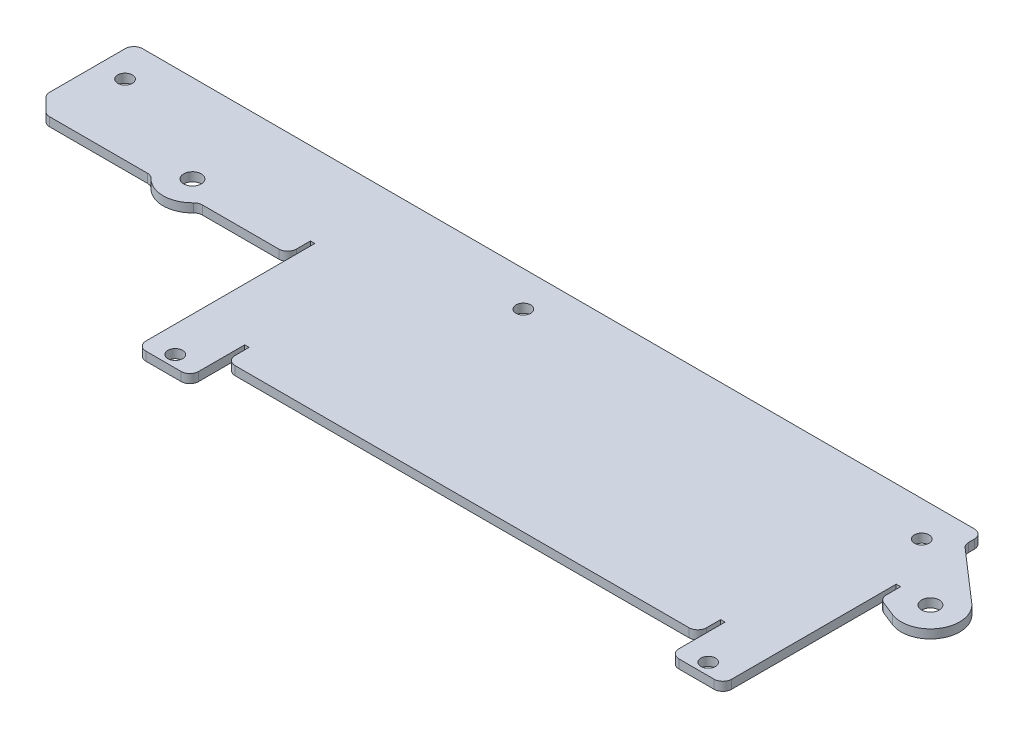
ISO-10303-21;
HEADER;
FILE_DESCRIPTION(('STEP AP214'),'2;1');
FILE_NAME('part.step','',(''),(''),'','','');
FILE_SCHEMA(('AUTOMOTIVE_DESIGN { 1 0 10303 214 1 1 1 1 }'));
ENDSEC;
DATA;
#1=APPLICATION_CONTEXT('core data for automotive mechanical design processes');
#2=APPLICATION_PROTOCOL_DEFINITION('international standard','automotive_design',2000,#1);
#3=PRODUCT_CONTEXT('',#1,'mechanical');
#4=PRODUCT('Part','Part','',(#3));
#5=PRODUCT_RELATED_PRODUCT_CATEGORY('part','',(#4));
#6=PRODUCT_DEFINITION_FORMATION('','',#4);
#7=PRODUCT_DEFINITION_CONTEXT('part definition',#1,'design');
#8=PRODUCT_DEFINITION('design','',#6,#7);
#9=PRODUCT_DEFINITION_SHAPE('','',#8);
#10=(LENGTH_UNIT() NAMED_UNIT(*) SI_UNIT(.MILLI.,.METRE.));
#11=(NAMED_UNIT(*) PLANE_ANGLE_UNIT() SI_UNIT($,.RADIAN.));
#12=(NAMED_UNIT(*) SI_UNIT($,.STERADIAN.) SOLID_ANGLE_UNIT());
#13=UNCERTAINTY_MEASURE_WITH_UNIT(LENGTH_MEASURE(1.E-05),#10,'distance_accuracy_value','');
#14=(GEOMETRIC_REPRESENTATION_CONTEXT(3) GLOBAL_UNCERTAINTY_ASSIGNED_CONTEXT((#13)) GLOBAL_UNIT_ASSIGNED_CONTEXT((#10,
#11,#12)) REPRESENTATION_CONTEXT('',''));
#15=CARTESIAN_POINT('',(0.,0.,0.));
#16=DIRECTION('',(0.,0.,1.));
#17=DIRECTION('',(1.,0.,0.));
#18=AXIS2_PLACEMENT_3D('',#15,#16,#17);
#19=CARTESIAN_POINT('',(0.,-1.50000000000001,7.96991118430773));
#20=DIRECTION('',(0.,-1.,0.));
#21=DIRECTION('',(0.,0.,-1.));
#22=AXIS2_PLACEMENT_3D('',#19,#20,#21);
#23=PLANE('',#22);
#24=DIRECTION('',(1.,0.,0.));
#25=VECTOR('',#24,1.);
#26=CARTESIAN_POINT('',(72.5,-1.50000000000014,29.9699111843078));
#27=LINE('',#26,#25);
#28=CARTESIAN_POINT('',(-16.25,-1.50000000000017,29.9699111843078));
#29=VERTEX_POINT('',#28);
#30=CARTESIAN_POINT('',(61.25,-1.50000000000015,29.9699111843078));
#31=VERTEX_POINT('',#30);
#32=EDGE_CURVE('E688',#29,#31,#27,.T.);
#33=ORIENTED_EDGE('',*,*,#32,.F.);
#34=CARTESIAN_POINT('',(-16.25,-1.50000000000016,28.4699111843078));
#35=DIRECTION('',(0.,-1.,0.));
#36=DIRECTION('',(0.,0.,-1.));
#37=AXIS2_PLACEMENT_3D('',#34,#35,#36);
#38=CIRCLE('',#37,1.5);
#39=CARTESIAN_POINT('',(-17.75,-1.50000000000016,28.4699111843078));
#40=VERTEX_POINT('',#39);
#41=EDGE_CURVE('E712',#29,#40,#38,.T.);
#42=ORIENTED_EDGE('',*,*,#41,.T.);
#43=DIRECTION('',(0.,0.,-1.));
#44=VECTOR('',#43,1.);
#45=CARTESIAN_POINT('',(-17.75,-1.50000000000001,7.96991118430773));
#46=LINE('',#45,#44);
#47=CARTESIAN_POINT('',(-17.75,-1.50000000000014,26.0699111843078));
#48=VERTEX_POINT('',#47);
#49=EDGE_CURVE('E629',#40,#48,#46,.T.);
#50=ORIENTED_EDGE('',*,*,#49,.T.);
#51=DIRECTION('',(-1.,0.,0.));
#52=VECTOR('',#51,1.);
#53=CARTESIAN_POINT('',(0.,-1.50000000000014,26.0699111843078));
#54=LINE('',#53,#52);
#55=CARTESIAN_POINT('',(-18.5,-1.50000000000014,26.0699111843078));
#56=VERTEX_POINT('',#55);
#57=EDGE_CURVE('E649',#48,#56,#54,.T.);
#58=ORIENTED_EDGE('',*,*,#57,.T.);
#59=DIRECTION('',(0.,0.,1.));
#60=VECTOR('',#59,1.);
#61=CARTESIAN_POINT('',(-18.5,-1.50000000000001,7.96991118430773));
#62=LINE('',#61,#60);
#63=CARTESIAN_POINT('',(-18.5,-1.50000000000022,33.9398223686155));
#64=VERTEX_POINT('',#63);
#65=EDGE_CURVE('E646',#56,#64,#62,.T.);
#66=ORIENTED_EDGE('',*,*,#65,.T.);
#67=CARTESIAN_POINT('',(-20.,-1.50000000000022,33.9398223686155));
#68=DIRECTION('',(0.,-1.,0.));
#69=DIRECTION('',(0.,0.,-1.));
#70=AXIS2_PLACEMENT_3D('',#67,#68,#69);
#71=CIRCLE('',#70,1.5);
#72=CARTESIAN_POINT('',(-20.,-1.50000000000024,35.4398223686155));
#73=VERTEX_POINT('',#72);
#74=EDGE_CURVE('E597',#64,#73,#71,.T.);
#75=ORIENTED_EDGE('',*,*,#74,.T.);
#76=DIRECTION('',(1.,0.,0.));
#77=VECTOR('',#76,1.);
#78=CARTESIAN_POINT('',(-91.,-1.50000000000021,35.4398223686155));
#79=LINE('',#78,#77);
#80=CARTESIAN_POINT('',(-26.,-1.50000000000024,35.4398223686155));
#81=VERTEX_POINT('',#80);
#82=EDGE_CURVE('E604',#73,#81,#79,.F.);
#83=ORIENTED_EDGE('',*,*,#82,.T.);
#84=CARTESIAN_POINT('',(-26.,-1.50000000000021,33.9398223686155));
#85=DIRECTION('',(0.,-1.,0.));
#86=DIRECTION('',(0.,0.,-1.));
#87=AXIS2_PLACEMENT_3D('',#84,#85,#86);
#88=CIRCLE('',#87,1.5);
#89=CARTESIAN_POINT('',(-27.5,-1.50000000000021,33.9398223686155));
#90=VERTEX_POINT('',#89);
#91=EDGE_CURVE('E600',#81,#90,#88,.T.);
#92=ORIENTED_EDGE('',*,*,#91,.T.);
#93=DIRECTION('',(0.,0.,1.));
#94=VECTOR('',#93,1.);
#95=CARTESIAN_POINT('',(-27.5,-1.50000000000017,29.9699111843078));
#96=LINE('',#95,#94);
#97=CARTESIAN_POINT('',(-27.5,-1.5,5.09999999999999));
#98=VERTEX_POINT('',#97);
#99=EDGE_CURVE('E692',#98,#90,#96,.T.);
#100=ORIENTED_EDGE('',*,*,#99,.F.);
#101=DIRECTION('',(1.,0.,0.));
#102=VECTOR('',#101,1.);
#103=CARTESIAN_POINT('',(0.,-1.5,5.09999999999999));
#104=LINE('',#103,#102);
#105=CARTESIAN_POINT('',(-28.25,-1.5,5.09999999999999));
#106=VERTEX_POINT('',#105);
#107=EDGE_CURVE('E463',#106,#98,#104,.T.);
#108=ORIENTED_EDGE('',*,*,#107,.F.);
#109=DIRECTION('',(0.,0.,-1.));
#110=VECTOR('',#109,1.);
#111=CARTESIAN_POINT('',(-28.25,-1.5,0.));
#112=LINE('',#111,#110);
#113=CARTESIAN_POINT('',(-28.25,-1.5,7.5));
#114=VERTEX_POINT('',#113);
#115=EDGE_CURVE('E471',#114,#106,#112,.T.);
#116=ORIENTED_EDGE('',*,*,#115,.F.);
#117=CARTESIAN_POINT('',(-29.75,-1.5,7.5));
#118=DIRECTION('',(0.,1.,0.));
#119=DIRECTION('',(0.,0.,1.));
#120=AXIS2_PLACEMENT_3D('',#117,#118,#119);
#121=CIRCLE('',#120,1.5);
#122=CARTESIAN_POINT('',(-29.75,-1.5,9.));
#123=VERTEX_POINT('',#122);
#124=EDGE_CURVE('E785',#114,#123,#121,.F.);
#125=ORIENTED_EDGE('',*,*,#124,.T.);
#126=DIRECTION('',(1.,0.,0.));
#127=VECTOR('',#126,1.);
#128=CARTESIAN_POINT('',(72.5,-1.5,8.99999999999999));
#129=LINE('',#128,#127);
#130=CARTESIAN_POINT('',(-42.8095842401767,-1.5,9.));
#131=VERTEX_POINT('',#130);
#132=EDGE_CURVE('E485',#131,#123,#129,.T.);
#133=ORIENTED_EDGE('',*,*,#132,.F.);
#134=CARTESIAN_POINT('',(-42.8095842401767,-1.5,10.5));
#135=DIRECTION('',(0.,1.,0.));
#136=DIRECTION('',(0.,0.,1.));
#137=AXIS2_PLACEMENT_3D('',#134,#135,#136);
#138=CIRCLE('',#137,1.5);
#139=CARTESIAN_POINT('',(-43.891987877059,-1.5,9.46153846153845));
#140=VERTEX_POINT('',#139);
#141=EDGE_CURVE('E782',#131,#140,#138,.T.);
#142=ORIENTED_EDGE('',*,*,#141,.T.);
#143=CARTESIAN_POINT('',(-47.5,-1.5,5.99999999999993));
#144=DIRECTION('',(0.,1.,0.));
#145=DIRECTION('',(0.,0.,1.));
#146=AXIS2_PLACEMENT_3D('',#143,#144,#145);
#147=CIRCLE('',#146,4.99999999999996);
#148=CARTESIAN_POINT('',(-51.108012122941,-1.5,9.46153846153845));
#149=VERTEX_POINT('',#148);
#150=EDGE_CURVE('E497',#149,#140,#147,.T.);
#151=ORIENTED_EDGE('',*,*,#150,.F.);
#152=CARTESIAN_POINT('',(-52.1904157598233,-1.5,10.5));
#153=DIRECTION('',(0.,1.,0.));
#154=DIRECTION('',(0.,0.,1.));
#155=AXIS2_PLACEMENT_3D('',#152,#153,#154);
#156=CIRCLE('',#155,1.5);
#157=CARTESIAN_POINT('',(-52.1904157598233,-1.5,9.));
#158=VERTEX_POINT('',#157);
#159=EDGE_CURVE('E779',#149,#158,#156,.T.);
#160=ORIENTED_EDGE('',*,*,#159,.T.);
#161=CARTESIAN_POINT('',(-68.8786796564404,-1.5,9.00000000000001));
#162=VERTEX_POINT('',#161);
#163=EDGE_CURVE('E490',#162,#158,#129,.T.);
#164=ORIENTED_EDGE('',*,*,#163,.F.);
#165=CARTESIAN_POINT('',(-68.8786796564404,-1.5,7.50000000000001));
#166=DIRECTION('',(0.,1.,0.));
#167=DIRECTION('',(0.,0.,1.));
#168=AXIS2_PLACEMENT_3D('',#165,#166,#167);
#169=CIRCLE('',#168,1.5);
#170=CARTESIAN_POINT('',(-69.9393398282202,-1.5,8.56066017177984));
#171=VERTEX_POINT('',#170);
#172=EDGE_CURVE('E776',#162,#171,#169,.F.);
#173=ORIENTED_EDGE('',*,*,#172,.T.);
#174=DIRECTION('',(0.707106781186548,0.,0.707106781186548));
#175=VECTOR('',#174,1.);
#176=CARTESIAN_POINT('',(-72.5,-1.5,6.00000000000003));
#177=LINE('',#176,#175);
#178=CARTESIAN_POINT('',(-72.0606601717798,-1.5,6.43933982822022));
#179=VERTEX_POINT('',#178);
#180=EDGE_CURVE('E769',#171,#179,#177,.F.);
#181=ORIENTED_EDGE('',*,*,#180,.T.);
#182=CARTESIAN_POINT('',(-71.,-1.5,5.37867965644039));
#183=DIRECTION('',(0.,1.,0.));
#184=DIRECTION('',(0.,0.,1.));
#185=AXIS2_PLACEMENT_3D('',#182,#183,#184);
#186=CIRCLE('',#185,1.5);
#187=CARTESIAN_POINT('',(-72.5,-1.5,5.37867965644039));
#188=VERTEX_POINT('',#187);
#189=EDGE_CURVE('E766',#179,#188,#186,.F.);
#190=ORIENTED_EDGE('',*,*,#189,.T.);
#191=DIRECTION('',(0.,0.,1.));
#192=VECTOR('',#191,1.);
#193=CARTESIAN_POINT('',(-72.5,-1.5,9.00000000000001));
#194=LINE('',#193,#192);
#195=CARTESIAN_POINT('',(-72.5,-1.5,-7.49999999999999));
#196=VERTEX_POINT('',#195);
#197=EDGE_CURVE('E406',#196,#188,#194,.T.);
#198=ORIENTED_EDGE('',*,*,#197,.F.);
#199=CARTESIAN_POINT('',(-71.,-1.5,-7.49999999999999));
#200=DIRECTION('',(0.,1.,0.));
#201=DIRECTION('',(0.,0.,1.));
#202=AXIS2_PLACEMENT_3D('',#199,#200,#201);
#203=CIRCLE('',#202,1.5);
#204=CARTESIAN_POINT('',(-71.,-1.5,-8.99999999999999));
#205=VERTEX_POINT('',#204);
#206=EDGE_CURVE('E814',#196,#205,#203,.F.);
#207=ORIENTED_EDGE('',*,*,#206,.T.);
#208=DIRECTION('',(-1.,0.,0.));
#209=VECTOR('',#208,1.);
#210=CARTESIAN_POINT('',(72.5,-1.5,-9.00000000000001));
#211=LINE('',#210,#209);
#212=CARTESIAN_POINT('',(71.,-1.5,-9.00000000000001));
#213=VERTEX_POINT('',#212);
#214=EDGE_CURVE('E408',#213,#205,#211,.T.);
#215=ORIENTED_EDGE('',*,*,#214,.F.);
#216=CARTESIAN_POINT('',(71.,-1.5,-7.50000000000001));
#217=DIRECTION('',(0.,1.,0.));
#218=DIRECTION('',(0.,0.,1.));
#219=AXIS2_PLACEMENT_3D('',#216,#217,#218);
#220=CIRCLE('',#219,1.5);
#221=CARTESIAN_POINT('',(72.5,-1.5,-7.50000000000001));
#222=VERTEX_POINT('',#221);
#223=EDGE_CURVE('E400',#213,#222,#220,.F.);
#224=ORIENTED_EDGE('',*,*,#223,.T.);
#225=DIRECTION('',(0.,0.,-1.));
#226=VECTOR('',#225,1.);
#227=CARTESIAN_POINT('',(72.5,-1.5,8.99999999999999));
#228=LINE('',#227,#226);
#229=CARTESIAN_POINT('',(72.5,-1.5,-6.53307750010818));
#230=VERTEX_POINT('',#229);
#231=EDGE_CURVE('E421',#230,#222,#228,.T.);
#232=ORIENTED_EDGE('',*,*,#231,.F.);
#233=CARTESIAN_POINT('',(74.,-1.5,-6.53307750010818));
#234=DIRECTION('',(0.,1.,0.));
#235=DIRECTION('',(0.,0.,1.));
#236=AXIS2_PLACEMENT_3D('',#233,#234,#235);
#237=CIRCLE('',#236,1.5);
#238=CARTESIAN_POINT('',(73.0152717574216,-1.5,-5.40156952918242));
#239=VERTEX_POINT('',#238);
#240=EDGE_CURVE('E809',#230,#239,#237,.T.);
#241=ORIENTED_EDGE('',*,*,#240,.T.);
#242=DIRECTION('',(0.754338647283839,0.,0.656485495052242));
#243=VECTOR('',#242,1.);
#244=CARTESIAN_POINT('',(72.5,-1.5,-5.84999999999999));
#245=LINE('',#244,#243);
#246=CARTESIAN_POINT('',(81.7824274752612,-1.5,2.22830676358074));
#247=VERTEX_POINT('',#246);
#248=EDGE_CURVE('E806',#239,#247,#245,.T.);
#249=ORIENTED_EDGE('',*,*,#248,.T.);
#250=CARTESIAN_POINT('',(78.5,-1.5,5.99999999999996));
#251=DIRECTION('',(0.,-1.,0.));
#252=DIRECTION('',(0.,0.,1.));
#253=AXIS2_PLACEMENT_3D('',#250,#251,#252);
#254=CIRCLE('',#253,5.);
#255=CARTESIAN_POINT('',(76.6573786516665,-1.5,10.6480906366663));
#256=VERTEX_POINT('',#255);
#257=EDGE_CURVE('E802',#247,#256,#254,.T.);
#258=ORIENTED_EDGE('',*,*,#257,.T.);
#259=DIRECTION('',(-0.92961812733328,0.,-0.368524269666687));
#260=VECTOR('',#259,1.);
#261=CARTESIAN_POINT('',(73.25,-1.5,9.29731907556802));
#262=LINE('',#261,#260);
#263=CARTESIAN_POINT('',(74.1972135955,-1.5,9.67281863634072));
#264=VERTEX_POINT('',#263);
#265=EDGE_CURVE('E798',#256,#264,#262,.T.);
#266=ORIENTED_EDGE('',*,*,#265,.T.);
#267=CARTESIAN_POINT('',(74.75,-1.5,8.2783914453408));
#268=DIRECTION('',(0.,1.,0.));
#269=DIRECTION('',(0.,0.,1.));
#270=AXIS2_PLACEMENT_3D('',#267,#268,#269);
#271=CIRCLE('',#270,1.5);
#272=CARTESIAN_POINT('',(73.25,-1.5,8.2783914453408));
#273=VERTEX_POINT('',#272);
#274=EDGE_CURVE('E795',#264,#273,#271,.F.);
#275=ORIENTED_EDGE('',*,*,#274,.T.);
#276=DIRECTION('',(0.,0.,-1.));
#277=VECTOR('',#276,1.);
#278=CARTESIAN_POINT('',(73.25,-1.5,5.84999999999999));
#279=LINE('',#278,#277);
#280=CARTESIAN_POINT('',(73.25,-1.5,5.84999999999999));
#281=VERTEX_POINT('',#280);
#282=EDGE_CURVE('E792',#273,#281,#279,.T.);
#283=ORIENTED_EDGE('',*,*,#282,.T.);
#284=DIRECTION('',(-1.,0.,0.));
#285=VECTOR('',#284,1.);
#286=CARTESIAN_POINT('',(72.5,-1.5,5.84999999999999));
#287=LINE('',#286,#285);
#288=CARTESIAN_POINT('',(72.5,-1.5,5.84999999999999));
#289=VERTEX_POINT('',#288);
#290=EDGE_CURVE('E788',#281,#289,#287,.T.);
#291=ORIENTED_EDGE('',*,*,#290,.T.);
#292=DIRECTION('',(0.,0.,-1.));
#293=VECTOR('',#292,1.);
#294=CARTESIAN_POINT('',(72.5,-1.49999999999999,7.96991118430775));
#295=LINE('',#294,#293);
#296=CARTESIAN_POINT('',(72.5,-1.50000000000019,33.9398223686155));
#297=VERTEX_POINT('',#296);
#298=EDGE_CURVE('E684',#297,#289,#295,.T.);
#299=ORIENTED_EDGE('',*,*,#298,.F.);
#300=CARTESIAN_POINT('',(71.,-1.50000000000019,33.9398223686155));
#301=DIRECTION('',(0.,-1.,0.));
#302=DIRECTION('',(0.,0.,-1.));
#303=AXIS2_PLACEMENT_3D('',#300,#301,#302);
#304=CIRCLE('',#303,1.5);
#305=CARTESIAN_POINT('',(71.,-1.50000000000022,35.4398223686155));
#306=VERTEX_POINT('',#305);
#307=EDGE_CURVE('E558',#297,#306,#304,.T.);
#308=ORIENTED_EDGE('',*,*,#307,.T.);
#309=DIRECTION('',(1.,0.,0.));
#310=VECTOR('',#309,1.);
#311=CARTESIAN_POINT('',(0.,-1.50000000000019,35.4398223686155));
#312=LINE('',#311,#310);
#313=CARTESIAN_POINT('',(65.,-1.50000000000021,35.4398223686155));
#314=VERTEX_POINT('',#313);
#315=EDGE_CURVE('E554',#306,#314,#312,.F.);
#316=ORIENTED_EDGE('',*,*,#315,.T.);
#317=CARTESIAN_POINT('',(65.,-1.50000000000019,33.9398223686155));
#318=DIRECTION('',(0.,-1.,0.));
#319=DIRECTION('',(0.,0.,-1.));
#320=AXIS2_PLACEMENT_3D('',#317,#318,#319);
#321=CIRCLE('',#320,1.5);
#322=CARTESIAN_POINT('',(63.5,-1.50000000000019,33.9398223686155));
#323=VERTEX_POINT('',#322);
#324=EDGE_CURVE('E550',#314,#323,#321,.T.);
#325=ORIENTED_EDGE('',*,*,#324,.T.);
#326=DIRECTION('',(0.,0.,-1.));
#327=VECTOR('',#326,1.);
#328=CARTESIAN_POINT('',(63.5,-1.49999999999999,7.96991118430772));
#329=LINE('',#328,#327);
#330=CARTESIAN_POINT('',(63.5,-1.50000000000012,26.0699111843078));
#331=VERTEX_POINT('',#330);
#332=EDGE_CURVE('E679',#323,#331,#329,.T.);
#333=ORIENTED_EDGE('',*,*,#332,.T.);
#334=DIRECTION('',(-1.,0.,0.));
#335=VECTOR('',#334,1.);
#336=CARTESIAN_POINT('',(0.,-1.50000000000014,26.0699111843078));
#337=LINE('',#336,#335);
#338=CARTESIAN_POINT('',(62.75,-1.50000000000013,26.0699111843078));
#339=VERTEX_POINT('',#338);
#340=EDGE_CURVE('E675',#331,#339,#337,.T.);
#341=ORIENTED_EDGE('',*,*,#340,.T.);
#342=DIRECTION('',(0.,0.,1.));
#343=VECTOR('',#342,1.);
#344=CARTESIAN_POINT('',(62.75,-1.49999999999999,7.96991118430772));
#345=LINE('',#344,#343);
#346=CARTESIAN_POINT('',(62.75,-1.50000000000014,28.4699111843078));
#347=VERTEX_POINT('',#346);
#348=EDGE_CURVE('E657',#339,#347,#345,.T.);
#349=ORIENTED_EDGE('',*,*,#348,.T.);
#350=CARTESIAN_POINT('',(61.25,-1.50000000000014,28.4699111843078));
#351=DIRECTION('',(0.,-1.,0.));
#352=DIRECTION('',(0.,0.,-1.));
#353=AXIS2_PLACEMENT_3D('',#350,#351,#352);
#354=CIRCLE('',#353,1.5);
#355=EDGE_CURVE('E709',#347,#31,#354,.T.);
#356=ORIENTED_EDGE('',*,*,#355,.T.);
#357=EDGE_LOOP('',(#33,#42,#50,#58,#66,#75,#83,#92,#100,#108,#116,#125,#133,#142,#151,#160,#164,
#173,#181,#190,#198,#207,#215,#224,#232,#241,#249,#258,#266,#275,#283,#291,#299,#308,#316,#325,
#333,#341,#349,#356));
#358=FACE_BOUND('',#357,.T.);
#359=CARTESIAN_POINT('',(-23.,-1.50000000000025,33.4398223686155));
#360=DIRECTION('',(0.,-1.,0.));
#361=DIRECTION('',(0.,0.,-1.));
#362=AXIS2_PLACEMENT_3D('',#359,#360,#361);
#363=CIRCLE('',#362,1.25);
#364=CARTESIAN_POINT('',(-23.,-1.50000000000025,32.1898223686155));
#365=VERTEX_POINT('',#364);
#366=EDGE_CURVE('E608',#365,#365,#363,.T.);
#367=ORIENTED_EDGE('',*,*,#366,.F.);
#368=EDGE_LOOP('',(#367));
#369=FACE_BOUND('',#368,.T.);
#370=CARTESIAN_POINT('',(68.,-1.50000000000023,33.4398223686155));
#371=DIRECTION('',(0.,-1.,0.));
#372=DIRECTION('',(0.,0.,-1.));
#373=AXIS2_PLACEMENT_3D('',#370,#371,#372);
#374=CIRCLE('',#373,1.25);
#375=CARTESIAN_POINT('',(68.,-1.50000000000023,32.1898223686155));
#376=VERTEX_POINT('',#375);
#377=EDGE_CURVE('E561',#376,#376,#374,.T.);
#378=ORIENTED_EDGE('',*,*,#377,.F.);
#379=EDGE_LOOP('',(#378));
#380=FACE_BOUND('',#379,.T.);
#381=CARTESIAN_POINT('',(-47.5,-1.50000000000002,5.99999999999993));
#382=DIRECTION('',(0.,1.,0.));
#383=DIRECTION('',(0.,0.,1.));
#384=AXIS2_PLACEMENT_3D('',#381,#382,#383);
#385=CIRCLE('',#384,1.5);
#386=CARTESIAN_POINT('',(-47.5,-1.50000000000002,7.49999999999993));
#387=VERTEX_POINT('',#386);
#388=EDGE_CURVE('E817',#387,#387,#385,.T.);
#389=ORIENTED_EDGE('',*,*,#388,.T.);
#390=EDGE_LOOP('',(#389));
#391=FACE_BOUND('',#390,.T.);
#392=CARTESIAN_POINT('',(-68.,-1.5,-3.00000000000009));
#393=DIRECTION('',(0.,-1.,0.));
#394=DIRECTION('',(0.,0.,-1.));
#395=AXIS2_PLACEMENT_3D('',#392,#393,#394);
#396=CIRCLE('',#395,1.25);
#397=CARTESIAN_POINT('',(-68.,-1.5,-4.25000000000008));
#398=VERTEX_POINT('',#397);
#399=EDGE_CURVE('E518',#398,#398,#396,.T.);
#400=ORIENTED_EDGE('',*,*,#399,.F.);
#401=EDGE_LOOP('',(#400));
#402=FACE_BOUND('',#401,.T.);
#403=CARTESIAN_POINT('',(0.,-1.5,-3.00000000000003));
#404=DIRECTION('',(0.,-1.,0.));
#405=DIRECTION('',(0.,0.,-1.));
#406=AXIS2_PLACEMENT_3D('',#403,#404,#405);
#407=CIRCLE('',#406,1.25);
#408=CARTESIAN_POINT('',(0.,-1.5,-4.25000000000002));
#409=VERTEX_POINT('',#408);
#410=EDGE_CURVE('E522',#409,#409,#407,.T.);
#411=ORIENTED_EDGE('',*,*,#410,.F.);
#412=EDGE_LOOP('',(#411));
#413=FACE_BOUND('',#412,.T.);
#414=CARTESIAN_POINT('',(68.,-1.5,-3.00000000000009));
#415=DIRECTION('',(0.,-1.,0.));
#416=DIRECTION('',(0.,0.,-1.));
#417=AXIS2_PLACEMENT_3D('',#414,#415,#416);
#418=CIRCLE('',#417,1.25);
#419=CARTESIAN_POINT('',(68.,-1.5,-4.25000000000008));
#420=VERTEX_POINT('',#419);
#421=EDGE_CURVE('E526',#420,#420,#418,.T.);
#422=ORIENTED_EDGE('',*,*,#421,.F.);
#423=EDGE_LOOP('',(#422));
#424=FACE_BOUND('',#423,.T.);
#425=CARTESIAN_POINT('',(78.5,-1.5,5.99999999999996));
#426=DIRECTION('',(0.,-1.,0.));
#427=DIRECTION('',(0.,0.,-1.));
#428=AXIS2_PLACEMENT_3D('',#425,#426,#427);
#429=CIRCLE('',#428,1.49999999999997);
#430=CARTESIAN_POINT('',(78.5,-1.5,4.49999999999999));
#431=VERTEX_POINT('',#430);
#432=EDGE_CURVE('E530',#431,#431,#429,.T.);
#433=ORIENTED_EDGE('',*,*,#432,.F.);
#434=EDGE_LOOP('',(#433));
#435=FACE_BOUND('',#434,.T.);
#436=ADVANCED_FACE('F113',(#358,#369,#380,#391,#402,#413,#424,#435),#23,.T.);
#437=CARTESIAN_POINT('',(0.,0.,0.));
#438=DIRECTION('',(0.,1.,0.));
#439=DIRECTION('',(0.,0.,1.));
#440=AXIS2_PLACEMENT_3D('',#437,#438,#439);
#441=PLANE('',#440);
#442=DIRECTION('',(0.,0.,-1.));
#443=VECTOR('',#442,1.);
#444=CARTESIAN_POINT('',(-17.75,-1.67400815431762E-13,29.9699111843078));
#445=LINE('',#444,#443);
#446=CARTESIAN_POINT('',(-17.75,-1.56125112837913E-13,28.4699111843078));
#447=VERTEX_POINT('',#446);
#448=CARTESIAN_POINT('',(-17.75,-1.4137996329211E-13,26.0699111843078));
#449=VERTEX_POINT('',#448);
#450=EDGE_CURVE('E626',#447,#449,#445,.T.);
#451=ORIENTED_EDGE('',*,*,#450,.F.);
#452=CARTESIAN_POINT('',(-16.25,-1.56992474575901E-13,28.4699111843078));
#453=DIRECTION('',(0.,-1.,0.));
#454=DIRECTION('',(0.,0.,-1.));
#455=AXIS2_PLACEMENT_3D('',#452,#453,#454);
#456=CIRCLE('',#455,1.5);
#457=CARTESIAN_POINT('',(-16.25,-1.6826817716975E-13,29.9699111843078));
#458=VERTEX_POINT('',#457);
#459=EDGE_CURVE('E122',#447,#458,#456,.F.);
#460=ORIENTED_EDGE('',*,*,#459,.T.);
#461=DIRECTION('',(-1.,0.,0.));
#462=VECTOR('',#461,1.);
#463=CARTESIAN_POINT('',(0.,-1.63931368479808E-13,29.9699111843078));
#464=LINE('',#463,#462);
#465=CARTESIAN_POINT('',(61.25,-1.4658413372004E-13,29.9699111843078));
#466=VERTEX_POINT('',#465);
#467=EDGE_CURVE('E698',#458,#466,#464,.F.);
#468=ORIENTED_EDGE('',*,*,#467,.T.);
#469=CARTESIAN_POINT('',(61.25,-1.36175792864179E-13,28.4699111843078));
#470=DIRECTION('',(0.,-1.,0.));
#471=DIRECTION('',(0.,0.,-1.));
#472=AXIS2_PLACEMENT_3D('',#469,#470,#471);
#473=CIRCLE('',#472,1.5);
#474=CARTESIAN_POINT('',(62.75,-1.30971622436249E-13,28.4699111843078));
#475=VERTEX_POINT('',#474);
#476=EDGE_CURVE('E129',#466,#475,#473,.F.);
#477=ORIENTED_EDGE('',*,*,#476,.T.);
#478=DIRECTION('',(0.,0.,1.));
#479=VECTOR('',#478,1.);
#480=CARTESIAN_POINT('',(62.75,-1.11022302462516E-13,26.0699111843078));
#481=LINE('',#480,#479);
#482=CARTESIAN_POINT('',(62.75,-1.11022302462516E-13,26.0699111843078));
#483=VERTEX_POINT('',#482);
#484=EDGE_CURVE('E663',#483,#475,#481,.T.);
#485=ORIENTED_EDGE('',*,*,#484,.F.);
#486=DIRECTION('',(-1.,0.,0.));
#487=VECTOR('',#486,1.);
#488=CARTESIAN_POINT('',(63.5,-1.11022302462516E-13,26.0699111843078));
#489=LINE('',#488,#487);
#490=CARTESIAN_POINT('',(63.5,-1.11022302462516E-13,26.0699111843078));
#491=VERTEX_POINT('',#490);
#492=EDGE_CURVE('E658',#491,#483,#489,.T.);
#493=ORIENTED_EDGE('',*,*,#492,.F.);
#494=DIRECTION('',(0.,0.,-1.));
#495=VECTOR('',#494,1.);
#496=CARTESIAN_POINT('',(63.5,-1.16226472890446E-13,26.8199111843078));
#497=LINE('',#496,#495);
#498=CARTESIAN_POINT('',(63.5,-1.8995222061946E-13,33.9398223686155));
#499=VERTEX_POINT('',#498);
#500=EDGE_CURVE('E653',#499,#491,#497,.T.);
#501=ORIENTED_EDGE('',*,*,#500,.F.);
#502=CARTESIAN_POINT('',(65.,-1.8995222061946E-13,33.9398223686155));
#503=DIRECTION('',(0.,-1.,0.));
#504=DIRECTION('',(0.,0.,-1.));
#505=AXIS2_PLACEMENT_3D('',#502,#503,#504);
#506=CIRCLE('',#505,1.5);
#507=CARTESIAN_POINT('',(65.,-2.12503625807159E-13,35.4398223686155));
#508=VERTEX_POINT('',#507);
#509=EDGE_CURVE('E539',#499,#508,#506,.F.);
#510=ORIENTED_EDGE('',*,*,#509,.T.);
#511=DIRECTION('',(-1.,0.,0.));
#512=VECTOR('',#511,1.);
#513=CARTESIAN_POINT('',(72.5,-2.15105711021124E-13,35.4398223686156));
#514=LINE('',#513,#512);
#515=CARTESIAN_POINT('',(71.,-2.15105711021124E-13,35.4398223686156));
#516=VERTEX_POINT('',#515);
#517=EDGE_CURVE('E572',#516,#508,#514,.T.);
#518=ORIENTED_EDGE('',*,*,#517,.F.);
#519=CARTESIAN_POINT('',(71.,-1.92554305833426E-13,33.9398223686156));
#520=DIRECTION('',(0.,-1.,0.));
#521=DIRECTION('',(0.,0.,-1.));
#522=AXIS2_PLACEMENT_3D('',#519,#520,#521);
#523=CIRCLE('',#522,1.5);
#524=CARTESIAN_POINT('',(72.5,-1.92554305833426E-13,33.9398223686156));
#525=VERTEX_POINT('',#524);
#526=EDGE_CURVE('E542',#516,#525,#523,.F.);
#527=ORIENTED_EDGE('',*,*,#526,.T.);
#528=DIRECTION('',(0.,0.,1.));
#529=VECTOR('',#528,1.);
#530=CARTESIAN_POINT('',(72.5,0.,7.96991118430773));
#531=LINE('',#530,#529);
#532=CARTESIAN_POINT('',(72.5,0.,5.84999999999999));
#533=VERTEX_POINT('',#532);
#534=EDGE_CURVE('E695',#525,#533,#531,.F.);
#535=ORIENTED_EDGE('',*,*,#534,.T.);
#536=DIRECTION('',(-1.,0.,0.));
#537=VECTOR('',#536,1.);
#538=CARTESIAN_POINT('',(72.5,0.,5.84999999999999));
#539=LINE('',#538,#537);
#540=CARTESIAN_POINT('',(73.25,0.,5.84999999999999));
#541=VERTEX_POINT('',#540);
#542=EDGE_CURVE('E893',#541,#533,#539,.T.);
#543=ORIENTED_EDGE('',*,*,#542,.F.);
#544=DIRECTION('',(0.,0.,-1.));
#545=VECTOR('',#544,1.);
#546=CARTESIAN_POINT('',(73.25,0.,5.84999999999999));
#547=LINE('',#546,#545);
#548=CARTESIAN_POINT('',(73.25,0.,8.2783914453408));
#549=VERTEX_POINT('',#548);
#550=EDGE_CURVE('E454',#549,#541,#547,.T.);
#551=ORIENTED_EDGE('',*,*,#550,.F.);
#552=CARTESIAN_POINT('',(74.75,0.,8.2783914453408));
#553=DIRECTION('',(0.,1.,0.));
#554=DIRECTION('',(0.,0.,1.));
#555=AXIS2_PLACEMENT_3D('',#552,#553,#554);
#556=CIRCLE('',#555,1.5);
#557=CARTESIAN_POINT('',(74.1972135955,0.,9.67281863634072));
#558=VERTEX_POINT('',#557);
#559=EDGE_CURVE('E886',#549,#558,#556,.T.);
#560=ORIENTED_EDGE('',*,*,#559,.T.);
#561=DIRECTION('',(-0.92961812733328,0.,-0.368524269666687));
#562=VECTOR('',#561,1.);
#563=CARTESIAN_POINT('',(73.25,0.,9.29731907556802));
#564=LINE('',#563,#562);
#565=CARTESIAN_POINT('',(76.6573786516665,0.,10.6480906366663));
#566=VERTEX_POINT('',#565);
#567=EDGE_CURVE('E446',#566,#558,#564,.T.);
#568=ORIENTED_EDGE('',*,*,#567,.F.);
#569=CARTESIAN_POINT('',(78.5,0.,5.99999999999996));
#570=DIRECTION('',(0.,-1.,0.));
#571=DIRECTION('',(0.,0.,1.));
#572=AXIS2_PLACEMENT_3D('',#569,#570,#571);
#573=CIRCLE('',#572,5.);
#574=CARTESIAN_POINT('',(81.7824274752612,0.,2.22830676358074));
#575=VERTEX_POINT('',#574);
#576=EDGE_CURVE('E438',#575,#566,#573,.T.);
#577=ORIENTED_EDGE('',*,*,#576,.F.);
#578=DIRECTION('',(0.754338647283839,0.,0.656485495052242));
#579=VECTOR('',#578,1.);
#580=CARTESIAN_POINT('',(72.5,0.,-5.84999999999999));
#581=LINE('',#580,#579);
#582=CARTESIAN_POINT('',(73.0152717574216,0.,-5.40156952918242));
#583=VERTEX_POINT('',#582);
#584=EDGE_CURVE('E429',#583,#575,#581,.T.);
#585=ORIENTED_EDGE('',*,*,#584,.F.);
#586=CARTESIAN_POINT('',(74.,0.,-6.53307750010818));
#587=DIRECTION('',(0.,1.,0.));
#588=DIRECTION('',(0.,0.,1.));
#589=AXIS2_PLACEMENT_3D('',#586,#587,#588);
#590=CIRCLE('',#589,1.5);
#591=CARTESIAN_POINT('',(72.5,0.,-6.53307750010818));
#592=VERTEX_POINT('',#591);
#593=EDGE_CURVE('E866',#583,#592,#590,.F.);
#594=ORIENTED_EDGE('',*,*,#593,.T.);
#595=DIRECTION('',(0.,0.,-1.));
#596=VECTOR('',#595,1.);
#597=CARTESIAN_POINT('',(72.5,0.,8.99999999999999));
#598=LINE('',#597,#596);
#599=CARTESIAN_POINT('',(72.5,0.,-7.50000000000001));
#600=VERTEX_POINT('',#599);
#601=EDGE_CURVE('E378',#592,#600,#598,.T.);
#602=ORIENTED_EDGE('',*,*,#601,.T.);
#603=CARTESIAN_POINT('',(71.,0.,-7.50000000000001));
#604=DIRECTION('',(0.,1.,0.));
#605=DIRECTION('',(0.,0.,1.));
#606=AXIS2_PLACEMENT_3D('',#603,#604,#605);
#607=CIRCLE('',#606,1.5);
#608=CARTESIAN_POINT('',(71.,0.,-9.00000000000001));
#609=VERTEX_POINT('',#608);
#610=EDGE_CURVE('E373',#600,#609,#607,.T.);
#611=ORIENTED_EDGE('',*,*,#610,.T.);
#612=DIRECTION('',(-1.,0.,0.));
#613=VECTOR('',#612,1.);
#614=CARTESIAN_POINT('',(72.5,0.,-9.00000000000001));
#615=LINE('',#614,#613);
#616=CARTESIAN_POINT('',(-71.,0.,-8.99999999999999));
#617=VERTEX_POINT('',#616);
#618=EDGE_CURVE('E376',#609,#617,#615,.T.);
#619=ORIENTED_EDGE('',*,*,#618,.T.);
#620=CARTESIAN_POINT('',(-71.,0.,-7.49999999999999));
#621=DIRECTION('',(0.,1.,0.));
#622=DIRECTION('',(0.,0.,1.));
#623=AXIS2_PLACEMENT_3D('',#620,#621,#622);
#624=CIRCLE('',#623,1.5);
#625=CARTESIAN_POINT('',(-72.5,0.,-7.49999999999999));
#626=VERTEX_POINT('',#625);
#627=EDGE_CURVE('E395',#617,#626,#624,.T.);
#628=ORIENTED_EDGE('',*,*,#627,.T.);
#629=DIRECTION('',(0.,0.,1.));
#630=VECTOR('',#629,1.);
#631=CARTESIAN_POINT('',(-72.5,0.,9.00000000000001));
#632=LINE('',#631,#630);
#633=CARTESIAN_POINT('',(-72.5,0.,5.37867965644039));
#634=VERTEX_POINT('',#633);
#635=EDGE_CURVE('E847',#626,#634,#632,.T.);
#636=ORIENTED_EDGE('',*,*,#635,.T.);
#637=CARTESIAN_POINT('',(-71.,0.,5.37867965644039));
#638=DIRECTION('',(0.,1.,0.));
#639=DIRECTION('',(0.,0.,1.));
#640=AXIS2_PLACEMENT_3D('',#637,#638,#639);
#641=CIRCLE('',#640,1.5);
#642=CARTESIAN_POINT('',(-72.0606601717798,0.,6.43933982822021));
#643=VERTEX_POINT('',#642);
#644=EDGE_CURVE('E842',#634,#643,#641,.T.);
#645=ORIENTED_EDGE('',*,*,#644,.T.);
#646=DIRECTION('',(-0.707106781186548,0.,-0.707106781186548));
#647=VECTOR('',#646,1.);
#648=CARTESIAN_POINT('',(-39.25,0.,39.25));
#649=LINE('',#648,#647);
#650=CARTESIAN_POINT('',(-69.9393398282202,0.,8.56066017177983));
#651=VERTEX_POINT('',#650);
#652=EDGE_CURVE('E846',#643,#651,#649,.F.);
#653=ORIENTED_EDGE('',*,*,#652,.T.);
#654=CARTESIAN_POINT('',(-68.8786796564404,0.,7.50000000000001));
#655=DIRECTION('',(0.,1.,0.));
#656=DIRECTION('',(0.,0.,1.));
#657=AXIS2_PLACEMENT_3D('',#654,#655,#656);
#658=CIRCLE('',#657,1.5);
#659=CARTESIAN_POINT('',(-68.8786796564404,0.,9.00000000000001));
#660=VERTEX_POINT('',#659);
#661=EDGE_CURVE('E851',#651,#660,#658,.T.);
#662=ORIENTED_EDGE('',*,*,#661,.T.);
#663=DIRECTION('',(1.,0.,0.));
#664=VECTOR('',#663,1.);
#665=CARTESIAN_POINT('',(72.5,0.,8.99999999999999));
#666=LINE('',#665,#664);
#667=CARTESIAN_POINT('',(-52.1904157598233,0.,9.));
#668=VERTEX_POINT('',#667);
#669=EDGE_CURVE('E931',#660,#668,#666,.T.);
#670=ORIENTED_EDGE('',*,*,#669,.T.);
#671=CARTESIAN_POINT('',(-52.1904157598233,0.,10.5));
#672=DIRECTION('',(0.,1.,0.));
#673=DIRECTION('',(0.,0.,1.));
#674=AXIS2_PLACEMENT_3D('',#671,#672,#673);
#675=CIRCLE('',#674,1.5);
#676=CARTESIAN_POINT('',(-51.108012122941,0.,9.46153846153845));
#677=VERTEX_POINT('',#676);
#678=EDGE_CURVE('E938',#668,#677,#675,.F.);
#679=ORIENTED_EDGE('',*,*,#678,.T.);
#680=CARTESIAN_POINT('',(-47.5,0.,5.99999999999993));
#681=DIRECTION('',(0.,1.,0.));
#682=DIRECTION('',(0.,0.,1.));
#683=AXIS2_PLACEMENT_3D('',#680,#681,#682);
#684=CIRCLE('',#683,4.99999999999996);
#685=CARTESIAN_POINT('',(-43.891987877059,0.,9.46153846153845));
#686=VERTEX_POINT('',#685);
#687=EDGE_CURVE('E934',#677,#686,#684,.T.);
#688=ORIENTED_EDGE('',*,*,#687,.T.);
#689=CARTESIAN_POINT('',(-42.8095842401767,0.,10.5));
#690=DIRECTION('',(0.,1.,0.));
#691=DIRECTION('',(0.,0.,1.));
#692=AXIS2_PLACEMENT_3D('',#689,#690,#691);
#693=CIRCLE('',#692,1.5);
#694=CARTESIAN_POINT('',(-42.8095842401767,0.,9.));
#695=VERTEX_POINT('',#694);
#696=EDGE_CURVE('E930',#686,#695,#693,.F.);
#697=ORIENTED_EDGE('',*,*,#696,.T.);
#698=CARTESIAN_POINT('',(-29.75,0.,9.));
#699=VERTEX_POINT('',#698);
#700=EDGE_CURVE('E926',#695,#699,#666,.T.);
#701=ORIENTED_EDGE('',*,*,#700,.T.);
#702=CARTESIAN_POINT('',(-29.75,0.,7.5));
#703=DIRECTION('',(0.,1.,0.));
#704=DIRECTION('',(0.,0.,1.));
#705=AXIS2_PLACEMENT_3D('',#702,#703,#704);
#706=CIRCLE('',#705,1.5);
#707=CARTESIAN_POINT('',(-28.25,0.,7.5));
#708=VERTEX_POINT('',#707);
#709=EDGE_CURVE('E923',#699,#708,#706,.T.);
#710=ORIENTED_EDGE('',*,*,#709,.T.);
#711=DIRECTION('',(0.,0.,1.));
#712=VECTOR('',#711,1.);
#713=CARTESIAN_POINT('',(-28.25,0.,5.09999999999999));
#714=LINE('',#713,#712);
#715=CARTESIAN_POINT('',(-28.25,0.,5.09999999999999));
#716=VERTEX_POINT('',#715);
#717=EDGE_CURVE('E478',#716,#708,#714,.T.);
#718=ORIENTED_EDGE('',*,*,#717,.F.);
#719=DIRECTION('',(-1.,0.,0.));
#720=VECTOR('',#719,1.);
#721=CARTESIAN_POINT('',(-27.5,0.,5.09999999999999));
#722=LINE('',#721,#720);
#723=CARTESIAN_POINT('',(-27.5,0.,5.09999999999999));
#724=VERTEX_POINT('',#723);
#725=EDGE_CURVE('E460',#724,#716,#722,.T.);
#726=ORIENTED_EDGE('',*,*,#725,.F.);
#727=DIRECTION('',(0.,0.,-1.));
#728=VECTOR('',#727,1.);
#729=CARTESIAN_POINT('',(-27.5,0.,7.96991118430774));
#730=LINE('',#729,#728);
#731=CARTESIAN_POINT('',(-27.5,-2.14238349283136E-13,33.9398223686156));
#732=VERTEX_POINT('',#731);
#733=EDGE_CURVE('E683',#724,#732,#730,.F.);
#734=ORIENTED_EDGE('',*,*,#733,.T.);
#735=CARTESIAN_POINT('',(-26.,-2.13370987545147E-13,33.9398223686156));
#736=DIRECTION('',(0.,-1.,0.));
#737=DIRECTION('',(0.,0.,-1.));
#738=AXIS2_PLACEMENT_3D('',#735,#736,#737);
#739=CIRCLE('',#738,1.5);
#740=CARTESIAN_POINT('',(-26.,-2.36789754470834E-13,35.4398223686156));
#741=VERTEX_POINT('',#740);
#742=EDGE_CURVE('E590',#732,#741,#739,.F.);
#743=ORIENTED_EDGE('',*,*,#742,.T.);
#744=DIRECTION('',(-1.,0.,0.));
#745=VECTOR('',#744,1.);
#746=CARTESIAN_POINT('',(-18.5,-2.38524477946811E-13,35.4398223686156));
#747=LINE('',#746,#745);
#748=CARTESIAN_POINT('',(-20.,-2.39391839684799E-13,35.4398223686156));
#749=VERTEX_POINT('',#748);
#750=EDGE_CURVE('E538',#749,#741,#747,.T.);
#751=ORIENTED_EDGE('',*,*,#750,.F.);
#752=CARTESIAN_POINT('',(-20.,-2.16840434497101E-13,33.9398223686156));
#753=DIRECTION('',(0.,-1.,0.));
#754=DIRECTION('',(0.,0.,-1.));
#755=AXIS2_PLACEMENT_3D('',#752,#753,#754);
#756=CIRCLE('',#755,1.5);
#757=CARTESIAN_POINT('',(-18.5,-2.15973072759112E-13,33.9398223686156));
#758=VERTEX_POINT('',#757);
#759=EDGE_CURVE('E586',#749,#758,#756,.F.);
#760=ORIENTED_EDGE('',*,*,#759,.T.);
#761=DIRECTION('',(0.,0.,1.));
#762=VECTOR('',#761,1.);
#763=CARTESIAN_POINT('',(-18.5,-1.39645239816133E-13,26.0699111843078));
#764=LINE('',#763,#762);
#765=CARTESIAN_POINT('',(-18.5,-1.4137996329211E-13,26.0699111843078));
#766=VERTEX_POINT('',#765);
#767=EDGE_CURVE('E635',#766,#758,#764,.T.);
#768=ORIENTED_EDGE('',*,*,#767,.F.);
#769=DIRECTION('',(-1.,0.,0.));
#770=VECTOR('',#769,1.);
#771=CARTESIAN_POINT('',(-17.75,-1.39645239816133E-13,26.0699111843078));
#772=LINE('',#771,#770);
#773=EDGE_CURVE('E630',#449,#766,#772,.T.);
#774=ORIENTED_EDGE('',*,*,#773,.F.);
#775=EDGE_LOOP('',(#451,#460,#468,#477,#485,#493,#501,#510,#518,#527,#535,#543,#551,#560,#568,
#577,#585,#594,#602,#611,#619,#628,#636,#645,#653,#662,#670,#679,#688,#697,#701,#710,#718,#726,
#734,#743,#751,#760,#768,#774));
#776=FACE_BOUND('',#775,.T.);
#777=CARTESIAN_POINT('',(-23.,-2.1163626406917E-13,33.4398223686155));
#778=DIRECTION('',(0.,-1.,0.));
#779=DIRECTION('',(0.,0.,-1.));
#780=AXIS2_PLACEMENT_3D('',#777,#778,#779);
#781=CIRCLE('',#780,1.25);
#782=CARTESIAN_POINT('',(-23.,-1.94233943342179E-13,32.1898223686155));
#783=VERTEX_POINT('',#782);
#784=EDGE_CURVE('E612',#783,#783,#781,.F.);
#785=ORIENTED_EDGE('',*,*,#784,.F.);
#786=EDGE_LOOP('',(#785));
#787=FACE_BOUND('',#786,.T.);
#788=CARTESIAN_POINT('',(68.,-1.83880688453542E-13,33.4398223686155));
#789=DIRECTION('',(0.,-1.,0.));
#790=DIRECTION('',(0.,0.,-1.));
#791=AXIS2_PLACEMENT_3D('',#788,#789,#790);
#792=CIRCLE('',#791,1.25);
#793=CARTESIAN_POINT('',(68.,-1.6647836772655E-13,32.1898223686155));
#794=VERTEX_POINT('',#793);
#795=EDGE_CURVE('E565',#794,#794,#792,.F.);
#796=ORIENTED_EDGE('',*,*,#795,.F.);
#797=EDGE_LOOP('',(#796));
#798=FACE_BOUND('',#797,.T.);
#799=CARTESIAN_POINT('',(-47.5,0.,5.99999999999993));
#800=DIRECTION('',(0.,1.,0.));
#801=DIRECTION('',(0.,0.,1.));
#802=AXIS2_PLACEMENT_3D('',#799,#800,#801);
#803=CIRCLE('',#802,1.5);
#804=CARTESIAN_POINT('',(-47.5,0.,7.49999999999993));
#805=VERTEX_POINT('',#804);
#806=EDGE_CURVE('E821',#805,#805,#803,.T.);
#807=ORIENTED_EDGE('',*,*,#806,.F.);
#808=EDGE_LOOP('',(#807));
#809=FACE_BOUND('',#808,.T.);
#810=CARTESIAN_POINT('',(-68.,0.,-3.00000000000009));
#811=DIRECTION('',(0.,1.,0.));
#812=DIRECTION('',(0.,0.,1.));
#813=AXIS2_PLACEMENT_3D('',#810,#811,#812);
#814=CIRCLE('',#813,1.25);
#815=CARTESIAN_POINT('',(-68.,0.,-1.75000000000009));
#816=VERTEX_POINT('',#815);
#817=EDGE_CURVE('E384',#816,#816,#814,.F.);
#818=ORIENTED_EDGE('',*,*,#817,.T.);
#819=EDGE_LOOP('',(#818));
#820=FACE_BOUND('',#819,.T.);
#821=CARTESIAN_POINT('',(0.,0.,-3.00000000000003));
#822=DIRECTION('',(0.,1.,0.));
#823=DIRECTION('',(0.,0.,1.));
#824=AXIS2_PLACEMENT_3D('',#821,#822,#823);
#825=CIRCLE('',#824,1.25);
#826=CARTESIAN_POINT('',(0.,0.,-1.75000000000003));
#827=VERTEX_POINT('',#826);
#828=EDGE_CURVE('E910',#827,#827,#825,.F.);
#829=ORIENTED_EDGE('',*,*,#828,.T.);
#830=EDGE_LOOP('',(#829));
#831=FACE_BOUND('',#830,.T.);
#832=CARTESIAN_POINT('',(68.,0.,-3.00000000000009));
#833=DIRECTION('',(0.,1.,0.));
#834=DIRECTION('',(0.,0.,1.));
#835=AXIS2_PLACEMENT_3D('',#832,#833,#834);
#836=CIRCLE('',#835,1.25);
#837=CARTESIAN_POINT('',(68.,0.,-1.75000000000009));
#838=VERTEX_POINT('',#837);
#839=EDGE_CURVE('E904',#838,#838,#836,.F.);
#840=ORIENTED_EDGE('',*,*,#839,.T.);
#841=EDGE_LOOP('',(#840));
#842=FACE_BOUND('',#841,.T.);
#843=CARTESIAN_POINT('',(78.5,0.,5.99999999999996));
#844=DIRECTION('',(0.,-1.,0.));
#845=DIRECTION('',(0.,0.,-1.));
#846=AXIS2_PLACEMENT_3D('',#843,#844,#845);
#847=CIRCLE('',#846,1.49999999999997);
#848=CARTESIAN_POINT('',(78.5,0.,4.49999999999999));
#849=VERTEX_POINT('',#848);
#850=EDGE_CURVE('E898',#849,#849,#847,.T.);
#851=ORIENTED_EDGE('',*,*,#850,.T.);
#852=EDGE_LOOP('',(#851));
#853=FACE_BOUND('',#852,.T.);
#854=ADVANCED_FACE('F115',(#776,#787,#798,#809,#820,#831,#842,#853),#441,.T.);
#855=CARTESIAN_POINT('',(72.5,-1.50000000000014,29.9699111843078));
#856=DIRECTION('',(0.,0.,1.));
#857=DIRECTION('',(0.,-1.,0.));
#858=AXIS2_PLACEMENT_3D('',#855,#856,#857);
#859=PLANE('',#858);
#860=ORIENTED_EDGE('',*,*,#467,.F.);
#861=DIRECTION('',(0.,-1.,0.));
#862=VECTOR('',#861,1.);
#863=CARTESIAN_POINT('',(-16.25,-1.50000000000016,29.9699111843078));
#864=LINE('',#863,#862);
#865=EDGE_CURVE('E705',#458,#29,#864,.T.);
#866=ORIENTED_EDGE('',*,*,#865,.T.);
#867=ORIENTED_EDGE('',*,*,#32,.T.);
#868=DIRECTION('',(0.,-1.,0.));
#869=VECTOR('',#868,1.);
#870=CARTESIAN_POINT('',(61.25,-1.50000000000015,29.9699111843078));
#871=LINE('',#870,#869);
#872=EDGE_CURVE('E687',#31,#466,#871,.F.);
#873=ORIENTED_EDGE('',*,*,#872,.T.);
#874=EDGE_LOOP('',(#860,#866,#867,#873));
#875=FACE_BOUND('',#874,.T.);
#876=ADVANCED_FACE('F725',(#875),#859,.T.);
#877=CARTESIAN_POINT('',(72.5,-1.49999999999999,7.96991118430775));
#878=DIRECTION('',(1.,0.,0.));
#879=DIRECTION('',(0.,1.,0.));
#880=AXIS2_PLACEMENT_3D('',#877,#878,#879);
#881=PLANE('',#880);
#882=ORIENTED_EDGE('',*,*,#534,.F.);
#883=DIRECTION('',(0.,1.,0.));
#884=VECTOR('',#883,1.);
#885=CARTESIAN_POINT('',(72.5,-1.50000000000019,33.9398223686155));
#886=LINE('',#885,#884);
#887=EDGE_CURVE('E546',#525,#297,#886,.F.);
#888=ORIENTED_EDGE('',*,*,#887,.T.);
#889=ORIENTED_EDGE('',*,*,#298,.T.);
#890=DIRECTION('',(0.,-1.,0.));
#891=VECTOR('',#890,1.);
#892=CARTESIAN_POINT('',(72.5,0.,5.84999999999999));
#893=LINE('',#892,#891);
#894=EDGE_CURVE('E580',#533,#289,#893,.T.);
#895=ORIENTED_EDGE('',*,*,#894,.F.);
#896=EDGE_LOOP('',(#882,#888,#889,#895));
#897=FACE_BOUND('',#896,.T.);
#898=ADVANCED_FACE('F993',(#897),#881,.T.);
#899=CARTESIAN_POINT('',(-27.5,-1.50000000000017,29.9699111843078));
#900=DIRECTION('',(-1.,0.,0.));
#901=DIRECTION('',(0.,-1.,0.));
#902=AXIS2_PLACEMENT_3D('',#899,#900,#901);
#903=PLANE('',#902);
#904=ORIENTED_EDGE('',*,*,#99,.T.);
#905=DIRECTION('',(0.,1.,0.));
#906=VECTOR('',#905,1.);
#907=CARTESIAN_POINT('',(-27.5,-1.50000000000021,33.9398223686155));
#908=LINE('',#907,#906);
#909=EDGE_CURVE('E581',#90,#732,#908,.T.);
#910=ORIENTED_EDGE('',*,*,#909,.T.);
#911=ORIENTED_EDGE('',*,*,#733,.F.);
#912=DIRECTION('',(0.,-1.,0.));
#913=VECTOR('',#912,1.);
#914=CARTESIAN_POINT('',(-27.5,0.,5.09999999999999));
#915=LINE('',#914,#913);
#916=EDGE_CURVE('E396',#724,#98,#915,.T.);
#917=ORIENTED_EDGE('',*,*,#916,.T.);
#918=EDGE_LOOP('',(#904,#910,#911,#917));
#919=FACE_BOUND('',#918,.T.);
#920=ADVANCED_FACE('F764',(#919),#903,.T.);
#921=CARTESIAN_POINT('',(63.5,-1.16226472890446E-13,26.8199111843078));
#922=DIRECTION('',(-1.,0.,0.));
#923=DIRECTION('',(0.,-1.,0.));
#924=AXIS2_PLACEMENT_3D('',#921,#922,#923);
#925=PLANE('',#924);
#926=ORIENTED_EDGE('',*,*,#332,.F.);
#927=DIRECTION('',(0.,1.,0.));
#928=VECTOR('',#927,1.);
#929=CARTESIAN_POINT('',(63.5,-1.50000000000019,33.9398223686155));
#930=LINE('',#929,#928);
#931=EDGE_CURVE('E534',#323,#499,#930,.T.);
#932=ORIENTED_EDGE('',*,*,#931,.T.);
#933=ORIENTED_EDGE('',*,*,#500,.T.);
#934=DIRECTION('',(0.,-1.,0.));
#935=VECTOR('',#934,1.);
#936=CARTESIAN_POINT('',(63.5,-1.11022302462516E-13,26.0699111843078));
#937=LINE('',#936,#935);
#938=EDGE_CURVE('E662',#491,#331,#937,.T.);
#939=ORIENTED_EDGE('',*,*,#938,.T.);
#940=EDGE_LOOP('',(#926,#932,#933,#939));
#941=FACE_BOUND('',#940,.T.);
#942=ADVANCED_FACE('F991',(#941),#925,.T.);
#943=CARTESIAN_POINT('',(63.5,-1.11022302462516E-13,26.0699111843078));
#944=DIRECTION('',(0.,0.,1.));
#945=DIRECTION('',(0.,-1.,0.));
#946=AXIS2_PLACEMENT_3D('',#943,#944,#945);
#947=PLANE('',#946);
#948=ORIENTED_EDGE('',*,*,#340,.F.);
#949=ORIENTED_EDGE('',*,*,#938,.F.);
#950=ORIENTED_EDGE('',*,*,#492,.T.);
#951=DIRECTION('',(0.,-1.,0.));
#952=VECTOR('',#951,1.);
#953=CARTESIAN_POINT('',(62.75,-1.11022302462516E-13,26.0699111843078));
#954=LINE('',#953,#952);
#955=EDGE_CURVE('E652',#483,#339,#954,.T.);
#956=ORIENTED_EDGE('',*,*,#955,.T.);
#957=EDGE_LOOP('',(#948,#949,#950,#956));
#958=FACE_BOUND('',#957,.T.);
#959=ADVANCED_FACE('F1013',(#958),#947,.T.);
#960=CARTESIAN_POINT('',(62.75,-1.11022302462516E-13,26.0699111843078));
#961=DIRECTION('',(1.,0.,0.));
#962=DIRECTION('',(0.,1.,0.));
#963=AXIS2_PLACEMENT_3D('',#960,#961,#962);
#964=PLANE('',#963);
#965=ORIENTED_EDGE('',*,*,#484,.T.);
#966=DIRECTION('',(0.,-1.,0.));
#967=VECTOR('',#966,1.);
#968=CARTESIAN_POINT('',(62.75,-1.28369537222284E-13,28.4699111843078));
#969=LINE('',#968,#967);
#970=EDGE_CURVE('E13',#475,#347,#969,.T.);
#971=ORIENTED_EDGE('',*,*,#970,.T.);
#972=ORIENTED_EDGE('',*,*,#348,.F.);
#973=ORIENTED_EDGE('',*,*,#955,.F.);
#974=EDGE_LOOP('',(#965,#971,#972,#973));
#975=FACE_BOUND('',#974,.T.);
#976=ADVANCED_FACE('F1011',(#975),#964,.T.);
#977=CARTESIAN_POINT('',(-17.75,-1.67400815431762E-13,29.9699111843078));
#978=DIRECTION('',(-1.,0.,0.));
#979=DIRECTION('',(0.,-1.,0.));
#980=AXIS2_PLACEMENT_3D('',#977,#978,#979);
#981=PLANE('',#980);
#982=ORIENTED_EDGE('',*,*,#49,.F.);
#983=DIRECTION('',(0.,-1.,0.));
#984=VECTOR('',#983,1.);
#985=CARTESIAN_POINT('',(-17.75,-1.56992474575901E-13,28.4699111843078));
#986=LINE('',#985,#984);
#987=EDGE_CURVE('E137',#40,#447,#986,.F.);
#988=ORIENTED_EDGE('',*,*,#987,.T.);
#989=ORIENTED_EDGE('',*,*,#450,.T.);
#990=DIRECTION('',(0.,-1.,0.));
#991=VECTOR('',#990,1.);
#992=CARTESIAN_POINT('',(-17.75,-1.39645239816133E-13,26.0699111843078));
#993=LINE('',#992,#991);
#994=EDGE_CURVE('E634',#449,#48,#993,.T.);
#995=ORIENTED_EDGE('',*,*,#994,.T.);
#996=EDGE_LOOP('',(#982,#988,#989,#995));
#997=FACE_BOUND('',#996,.T.);
#998=ADVANCED_FACE('F732',(#997),#981,.T.);
#999=CARTESIAN_POINT('',(-17.75,-1.39645239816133E-13,26.0699111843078));
#1000=DIRECTION('',(0.,0.,1.));
#1001=DIRECTION('',(0.,-1.,0.));
#1002=AXIS2_PLACEMENT_3D('',#999,#1000,#1001);
#1003=PLANE('',#1002);
#1004=ORIENTED_EDGE('',*,*,#57,.F.);
#1005=ORIENTED_EDGE('',*,*,#994,.F.);
#1006=ORIENTED_EDGE('',*,*,#773,.T.);
#1007=DIRECTION('',(0.,-1.,0.));
#1008=VECTOR('',#1007,1.);
#1009=CARTESIAN_POINT('',(-18.5,-1.39645239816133E-13,26.0699111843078));
#1010=LINE('',#1009,#1008);
#1011=EDGE_CURVE('E585',#766,#56,#1010,.T.);
#1012=ORIENTED_EDGE('',*,*,#1011,.T.);
#1013=EDGE_LOOP('',(#1004,#1005,#1006,#1012));
#1014=FACE_BOUND('',#1013,.T.);
#1015=ADVANCED_FACE('F735',(#1014),#1003,.T.);
#1016=CARTESIAN_POINT('',(-18.5,-1.39645239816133E-13,26.0699111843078));
#1017=DIRECTION('',(1.,0.,0.));
#1018=DIRECTION('',(0.,1.,0.));
#1019=AXIS2_PLACEMENT_3D('',#1016,#1017,#1018);
#1020=PLANE('',#1019);
#1021=ORIENTED_EDGE('',*,*,#65,.F.);
#1022=ORIENTED_EDGE('',*,*,#1011,.F.);
#1023=ORIENTED_EDGE('',*,*,#767,.T.);
#1024=DIRECTION('',(0.,1.,0.));
#1025=VECTOR('',#1024,1.);
#1026=CARTESIAN_POINT('',(-18.5,-1.50000000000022,33.9398223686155));
#1027=LINE('',#1026,#1025);
#1028=EDGE_CURVE('E593',#758,#64,#1027,.F.);
#1029=ORIENTED_EDGE('',*,*,#1028,.T.);
#1030=EDGE_LOOP('',(#1021,#1022,#1023,#1029));
#1031=FACE_BOUND('',#1030,.T.);
#1032=ADVANCED_FACE('F739',(#1031),#1020,.T.);
#1033=CARTESIAN_POINT('',(-16.25,-1.50000000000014,28.4699111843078));
#1034=DIRECTION('',(0.,-1.,0.));
#1035=DIRECTION('',(0.,0.,-1.));
#1036=AXIS2_PLACEMENT_3D('',#1033,#1034,#1035);
#1037=CYLINDRICAL_SURFACE('',#1036,1.5);
#1038=ORIENTED_EDGE('',*,*,#459,.F.);
#1039=ORIENTED_EDGE('',*,*,#987,.F.);
#1040=ORIENTED_EDGE('',*,*,#41,.F.);
#1041=ORIENTED_EDGE('',*,*,#865,.F.);
#1042=EDGE_LOOP('',(#1038,#1039,#1040,#1041));
#1043=FACE_BOUND('',#1042,.T.);
#1044=ADVANCED_FACE('F728',(#1043),#1037,.T.);
#1045=CARTESIAN_POINT('',(61.25,-1.28369537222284E-13,28.4699111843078));
#1046=DIRECTION('',(0.,-1.,0.));
#1047=DIRECTION('',(0.,0.,-1.));
#1048=AXIS2_PLACEMENT_3D('',#1045,#1046,#1047);
#1049=CYLINDRICAL_SURFACE('',#1048,1.5);
#1050=ORIENTED_EDGE('',*,*,#476,.F.);
#1051=ORIENTED_EDGE('',*,*,#872,.F.);
#1052=ORIENTED_EDGE('',*,*,#355,.F.);
#1053=ORIENTED_EDGE('',*,*,#970,.F.);
#1054=EDGE_LOOP('',(#1050,#1051,#1052,#1053));
#1055=FACE_BOUND('',#1054,.T.);
#1056=ADVANCED_FACE('F1002',(#1055),#1049,.T.);
#1057=CARTESIAN_POINT('',(-20.,-1.50000000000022,33.9398223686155));
#1058=DIRECTION('',(0.,1.,0.));
#1059=DIRECTION('',(0.,0.,1.));
#1060=AXIS2_PLACEMENT_3D('',#1057,#1058,#1059);
#1061=CYLINDRICAL_SURFACE('',#1060,1.5);
#1062=ORIENTED_EDGE('',*,*,#74,.F.);
#1063=ORIENTED_EDGE('',*,*,#1028,.F.);
#1064=ORIENTED_EDGE('',*,*,#759,.F.);
#1065=DIRECTION('',(0.,1.,0.));
#1066=VECTOR('',#1065,1.);
#1067=CARTESIAN_POINT('',(-20.,-1.50000000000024,35.4398223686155));
#1068=LINE('',#1067,#1066);
#1069=EDGE_CURVE('E616',#73,#749,#1068,.T.);
#1070=ORIENTED_EDGE('',*,*,#1069,.F.);
#1071=EDGE_LOOP('',(#1062,#1063,#1064,#1070));
#1072=FACE_BOUND('',#1071,.T.);
#1073=ADVANCED_FACE('F744',(#1072),#1061,.T.);
#1074=CARTESIAN_POINT('',(-26.,-1.50000000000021,33.9398223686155));
#1075=DIRECTION('',(0.,1.,0.));
#1076=DIRECTION('',(0.,0.,1.));
#1077=AXIS2_PLACEMENT_3D('',#1074,#1075,#1076);
#1078=CYLINDRICAL_SURFACE('',#1077,1.5);
#1079=ORIENTED_EDGE('',*,*,#91,.F.);
#1080=DIRECTION('',(0.,1.,0.));
#1081=VECTOR('',#1080,1.);
#1082=CARTESIAN_POINT('',(-26.,-1.50000000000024,35.4398223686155));
#1083=LINE('',#1082,#1081);
#1084=EDGE_CURVE('E620',#741,#81,#1083,.F.);
#1085=ORIENTED_EDGE('',*,*,#1084,.F.);
#1086=ORIENTED_EDGE('',*,*,#742,.F.);
#1087=ORIENTED_EDGE('',*,*,#909,.F.);
#1088=EDGE_LOOP('',(#1079,#1085,#1086,#1087));
#1089=FACE_BOUND('',#1088,.T.);
#1090=ADVANCED_FACE('F753',(#1089),#1078,.T.);
#1091=CARTESIAN_POINT('',(-18.5,-1.50000000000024,35.4398223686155));
#1092=DIRECTION('',(0.,0.,-1.));
#1093=DIRECTION('',(0.,1.,0.));
#1094=AXIS2_PLACEMENT_3D('',#1091,#1092,#1093);
#1095=PLANE('',#1094);
#1096=ORIENTED_EDGE('',*,*,#750,.T.);
#1097=ORIENTED_EDGE('',*,*,#1084,.T.);
#1098=ORIENTED_EDGE('',*,*,#82,.F.);
#1099=ORIENTED_EDGE('',*,*,#1069,.T.);
#1100=EDGE_LOOP('',(#1096,#1097,#1098,#1099));
#1101=FACE_BOUND('',#1100,.T.);
#1102=ADVANCED_FACE('F748',(#1101),#1095,.F.);
#1103=CARTESIAN_POINT('',(-23.,3.53553390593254,33.4398223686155));
#1104=DIRECTION('',(0.,-1.,0.));
#1105=DIRECTION('',(0.,0.,-1.));
#1106=AXIS2_PLACEMENT_3D('',#1103,#1104,#1105);
#1107=CYLINDRICAL_SURFACE('',#1106,1.25);
#1108=ORIENTED_EDGE('',*,*,#784,.T.);
#1109=EDGE_LOOP('',(#1108));
#1110=FACE_BOUND('',#1109,.T.);
#1111=ORIENTED_EDGE('',*,*,#366,.T.);
#1112=EDGE_LOOP('',(#1111));
#1113=FACE_BOUND('',#1112,.T.);
#1114=ADVANCED_FACE('F1044',(#1110,#1113),#1107,.F.);
#1115=CARTESIAN_POINT('',(65.,-1.50000000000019,33.9398223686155));
#1116=DIRECTION('',(0.,1.,0.));
#1117=DIRECTION('',(0.,0.,1.));
#1118=AXIS2_PLACEMENT_3D('',#1115,#1116,#1117);
#1119=CYLINDRICAL_SURFACE('',#1118,1.5);
#1120=ORIENTED_EDGE('',*,*,#324,.F.);
#1121=DIRECTION('',(0.,1.,0.));
#1122=VECTOR('',#1121,1.);
#1123=CARTESIAN_POINT('',(65.,-1.50000000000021,35.4398223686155));
#1124=LINE('',#1123,#1122);
#1125=EDGE_CURVE('E569',#508,#314,#1124,.F.);
#1126=ORIENTED_EDGE('',*,*,#1125,.F.);
#1127=ORIENTED_EDGE('',*,*,#509,.F.);
#1128=ORIENTED_EDGE('',*,*,#931,.F.);
#1129=EDGE_LOOP('',(#1120,#1126,#1127,#1128));
#1130=FACE_BOUND('',#1129,.T.);
#1131=ADVANCED_FACE('F1022',(#1130),#1119,.T.);
#1132=CARTESIAN_POINT('',(72.5,-1.50000000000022,35.4398223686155));
#1133=DIRECTION('',(0.,0.,-1.));
#1134=DIRECTION('',(0.,1.,0.));
#1135=AXIS2_PLACEMENT_3D('',#1132,#1133,#1134);
#1136=PLANE('',#1135);
#1137=ORIENTED_EDGE('',*,*,#315,.F.);
#1138=DIRECTION('',(0.,1.,0.));
#1139=VECTOR('',#1138,1.);
#1140=CARTESIAN_POINT('',(71.,-1.50000000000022,35.4398223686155));
#1141=LINE('',#1140,#1139);
#1142=EDGE_CURVE('E576',#306,#516,#1141,.T.);
#1143=ORIENTED_EDGE('',*,*,#1142,.T.);
#1144=ORIENTED_EDGE('',*,*,#517,.T.);
#1145=ORIENTED_EDGE('',*,*,#1125,.T.);
#1146=EDGE_LOOP('',(#1137,#1143,#1144,#1145));
#1147=FACE_BOUND('',#1146,.T.);
#1148=ADVANCED_FACE('F1025',(#1147),#1136,.F.);
#1149=CARTESIAN_POINT('',(71.,-1.50000000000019,33.9398223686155));
#1150=DIRECTION('',(0.,1.,0.));
#1151=DIRECTION('',(0.,0.,1.));
#1152=AXIS2_PLACEMENT_3D('',#1149,#1150,#1151);
#1153=CYLINDRICAL_SURFACE('',#1152,1.5);
#1154=ORIENTED_EDGE('',*,*,#307,.F.);
#1155=ORIENTED_EDGE('',*,*,#887,.F.);
#1156=ORIENTED_EDGE('',*,*,#526,.F.);
#1157=ORIENTED_EDGE('',*,*,#1142,.F.);
#1158=EDGE_LOOP('',(#1154,#1155,#1156,#1157));
#1159=FACE_BOUND('',#1158,.T.);
#1160=ADVANCED_FACE('F1030',(#1159),#1153,.T.);
#1161=CARTESIAN_POINT('',(68.,3.53553390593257,33.4398223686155));
#1162=DIRECTION('',(0.,-1.,0.));
#1163=DIRECTION('',(0.,0.,-1.));
#1164=AXIS2_PLACEMENT_3D('',#1161,#1162,#1163);
#1165=CYLINDRICAL_SURFACE('',#1164,1.25);
#1166=ORIENTED_EDGE('',*,*,#795,.T.);
#1167=EDGE_LOOP('',(#1166));
#1168=FACE_BOUND('',#1167,.T.);
#1169=ORIENTED_EDGE('',*,*,#377,.T.);
#1170=EDGE_LOOP('',(#1169));
#1171=FACE_BOUND('',#1170,.T.);
#1172=ADVANCED_FACE('F1049',(#1168,#1171),#1165,.F.);
#1173=CARTESIAN_POINT('',(78.5,0.,5.99999999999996));
#1174=DIRECTION('',(0.,-1.,0.));
#1175=DIRECTION('',(0.,0.,-1.));
#1176=AXIS2_PLACEMENT_3D('',#1173,#1174,#1175);
#1177=CYLINDRICAL_SURFACE('',#1176,1.49999999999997);
#1178=ORIENTED_EDGE('',*,*,#850,.F.);
#1179=EDGE_LOOP('',(#1178));
#1180=FACE_BOUND('',#1179,.T.);
#1181=ORIENTED_EDGE('',*,*,#432,.T.);
#1182=EDGE_LOOP('',(#1181));
#1183=FACE_BOUND('',#1182,.T.);
#1184=ADVANCED_FACE('F1051',(#1180,#1183),#1177,.F.);
#1185=CARTESIAN_POINT('',(68.,22.0010000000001,-3.00000000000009));
#1186=DIRECTION('',(0.,-1.,0.));
#1187=DIRECTION('',(0.,0.,-1.));
#1188=AXIS2_PLACEMENT_3D('',#1185,#1186,#1187);
#1189=CYLINDRICAL_SURFACE('',#1188,1.25);
#1190=ORIENTED_EDGE('',*,*,#839,.F.);
#1191=EDGE_LOOP('',(#1190));
#1192=FACE_BOUND('',#1191,.T.);
#1193=ORIENTED_EDGE('',*,*,#421,.T.);
#1194=EDGE_LOOP('',(#1193));
#1195=FACE_BOUND('',#1194,.T.);
#1196=ADVANCED_FACE('F1166',(#1192,#1195),#1189,.F.);
#1197=CARTESIAN_POINT('',(0.,22.0010000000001,-3.00000000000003));
#1198=DIRECTION('',(0.,-1.,0.));
#1199=DIRECTION('',(0.,0.,-1.));
#1200=AXIS2_PLACEMENT_3D('',#1197,#1198,#1199);
#1201=CYLINDRICAL_SURFACE('',#1200,1.25);
#1202=ORIENTED_EDGE('',*,*,#828,.F.);
#1203=EDGE_LOOP('',(#1202));
#1204=FACE_BOUND('',#1203,.T.);
#1205=ORIENTED_EDGE('',*,*,#410,.T.);
#1206=EDGE_LOOP('',(#1205));
#1207=FACE_BOUND('',#1206,.T.);
#1208=ADVANCED_FACE('F1177',(#1204,#1207),#1201,.F.);
#1209=CARTESIAN_POINT('',(-68.,22.0010000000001,-3.00000000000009));
#1210=DIRECTION('',(0.,-1.,0.));
#1211=DIRECTION('',(0.,0.,-1.));
#1212=AXIS2_PLACEMENT_3D('',#1209,#1210,#1211);
#1213=CYLINDRICAL_SURFACE('',#1212,1.25);
#1214=ORIENTED_EDGE('',*,*,#817,.F.);
#1215=EDGE_LOOP('',(#1214));
#1216=FACE_BOUND('',#1215,.T.);
#1217=ORIENTED_EDGE('',*,*,#399,.T.);
#1218=EDGE_LOOP('',(#1217));
#1219=FACE_BOUND('',#1218,.T.);
#1220=ADVANCED_FACE('F1188',(#1216,#1219),#1213,.F.);
#1221=CARTESIAN_POINT('',(-71.,-1.5,5.37867965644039));
#1222=DIRECTION('',(0.,-1.,0.));
#1223=DIRECTION('',(0.,0.,-1.));
#1224=AXIS2_PLACEMENT_3D('',#1221,#1222,#1223);
#1225=CYLINDRICAL_SURFACE('',#1224,1.5);
#1226=ORIENTED_EDGE('',*,*,#189,.F.);
#1227=DIRECTION('',(0.,1.,0.));
#1228=VECTOR('',#1227,1.);
#1229=CARTESIAN_POINT('',(-72.0606601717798,-1.5,6.43933982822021));
#1230=LINE('',#1229,#1228);
#1231=EDGE_CURVE('E512',#643,#179,#1230,.F.);
#1232=ORIENTED_EDGE('',*,*,#1231,.F.);
#1233=ORIENTED_EDGE('',*,*,#644,.F.);
#1234=DIRECTION('',(0.,-1.,0.));
#1235=VECTOR('',#1234,1.);
#1236=CARTESIAN_POINT('',(-72.5,-1.5,5.37867965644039));
#1237=LINE('',#1236,#1235);
#1238=EDGE_CURVE('E825',#188,#634,#1237,.F.);
#1239=ORIENTED_EDGE('',*,*,#1238,.F.);
#1240=EDGE_LOOP('',(#1226,#1232,#1233,#1239));
#1241=FACE_BOUND('',#1240,.T.);
#1242=ADVANCED_FACE('F840',(#1241),#1225,.T.);
#1243=CARTESIAN_POINT('',(-72.5,-1.5,6.00000000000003));
#1244=DIRECTION('',(0.707106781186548,0.,-0.707106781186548));
#1245=DIRECTION('',(0.,1.,0.));
#1246=AXIS2_PLACEMENT_3D('',#1243,#1244,#1245);
#1247=PLANE('',#1246);
#1248=ORIENTED_EDGE('',*,*,#180,.F.);
#1249=DIRECTION('',(0.,-1.,0.));
#1250=VECTOR('',#1249,1.);
#1251=CARTESIAN_POINT('',(-69.9393398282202,-1.5,8.56066017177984));
#1252=LINE('',#1251,#1250);
#1253=EDGE_CURVE('E515',#171,#651,#1252,.F.);
#1254=ORIENTED_EDGE('',*,*,#1253,.T.);
#1255=ORIENTED_EDGE('',*,*,#652,.F.);
#1256=ORIENTED_EDGE('',*,*,#1231,.T.);
#1257=EDGE_LOOP('',(#1248,#1254,#1255,#1256));
#1258=FACE_BOUND('',#1257,.T.);
#1259=ADVANCED_FACE('F1209',(#1258),#1247,.F.);
#1260=CARTESIAN_POINT('',(-68.8786796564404,-1.5,7.50000000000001));
#1261=DIRECTION('',(0.,1.,0.));
#1262=DIRECTION('',(0.,0.,1.));
#1263=AXIS2_PLACEMENT_3D('',#1260,#1261,#1262);
#1264=CYLINDRICAL_SURFACE('',#1263,1.5);
#1265=ORIENTED_EDGE('',*,*,#661,.F.);
#1266=ORIENTED_EDGE('',*,*,#1253,.F.);
#1267=ORIENTED_EDGE('',*,*,#172,.F.);
#1268=DIRECTION('',(0.,1.,0.));
#1269=VECTOR('',#1268,1.);
#1270=CARTESIAN_POINT('',(-68.8786796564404,-1.5,9.00000000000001));
#1271=LINE('',#1270,#1269);
#1272=EDGE_CURVE('E508',#660,#162,#1271,.F.);
#1273=ORIENTED_EDGE('',*,*,#1272,.F.);
#1274=EDGE_LOOP('',(#1265,#1266,#1267,#1273));
#1275=FACE_BOUND('',#1274,.T.);
#1276=ADVANCED_FACE('F1219',(#1275),#1264,.T.);
#1277=CARTESIAN_POINT('',(72.5,-1.5,8.99999999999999));
#1278=DIRECTION('',(0.,0.,1.));
#1279=DIRECTION('',(1.,0.,0.));
#1280=AXIS2_PLACEMENT_3D('',#1277,#1278,#1279);
#1281=PLANE('',#1280);
#1282=ORIENTED_EDGE('',*,*,#669,.F.);
#1283=ORIENTED_EDGE('',*,*,#1272,.T.);
#1284=ORIENTED_EDGE('',*,*,#163,.T.);
#1285=DIRECTION('',(0.,-1.,0.));
#1286=VECTOR('',#1285,1.);
#1287=CARTESIAN_POINT('',(-52.1904157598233,0.,9.));
#1288=LINE('',#1287,#1286);
#1289=EDGE_CURVE('E505',#158,#668,#1288,.F.);
#1290=ORIENTED_EDGE('',*,*,#1289,.T.);
#1291=EDGE_LOOP('',(#1282,#1283,#1284,#1290));
#1292=FACE_BOUND('',#1291,.T.);
#1293=ADVANCED_FACE('F1230',(#1292),#1281,.T.);
#1294=CARTESIAN_POINT('',(-52.1904157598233,-1.5,10.5));
#1295=DIRECTION('',(0.,1.,0.));
#1296=DIRECTION('',(0.,0.,1.));
#1297=AXIS2_PLACEMENT_3D('',#1294,#1295,#1296);
#1298=CYLINDRICAL_SURFACE('',#1297,1.5);
#1299=ORIENTED_EDGE('',*,*,#678,.F.);
#1300=ORIENTED_EDGE('',*,*,#1289,.F.);
#1301=ORIENTED_EDGE('',*,*,#159,.F.);
#1302=DIRECTION('',(0.,1.,0.));
#1303=VECTOR('',#1302,1.);
#1304=CARTESIAN_POINT('',(-51.108012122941,-1.5,9.46153846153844));
#1305=LINE('',#1304,#1303);
#1306=EDGE_CURVE('E501',#677,#149,#1305,.F.);
#1307=ORIENTED_EDGE('',*,*,#1306,.F.);
#1308=EDGE_LOOP('',(#1299,#1300,#1301,#1307));
#1309=FACE_BOUND('',#1308,.T.);
#1310=ADVANCED_FACE('F952',(#1309),#1298,.F.);
#1311=CARTESIAN_POINT('',(-47.5,-1.5,5.99999999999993));
#1312=DIRECTION('',(0.,1.,0.));
#1313=DIRECTION('',(0.,0.,1.));
#1314=AXIS2_PLACEMENT_3D('',#1311,#1312,#1313);
#1315=CYLINDRICAL_SURFACE('',#1314,4.99999999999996);
#1316=ORIENTED_EDGE('',*,*,#687,.F.);
#1317=ORIENTED_EDGE('',*,*,#1306,.T.);
#1318=ORIENTED_EDGE('',*,*,#150,.T.);
#1319=DIRECTION('',(0.,1.,0.));
#1320=VECTOR('',#1319,1.);
#1321=CARTESIAN_POINT('',(-43.891987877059,-1.5,9.46153846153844));
#1322=LINE('',#1321,#1320);
#1323=EDGE_CURVE('E493',#140,#686,#1322,.T.);
#1324=ORIENTED_EDGE('',*,*,#1323,.T.);
#1325=EDGE_LOOP('',(#1316,#1317,#1318,#1324));
#1326=FACE_BOUND('',#1325,.T.);
#1327=ADVANCED_FACE('F955',(#1326),#1315,.T.);
#1328=CARTESIAN_POINT('',(-42.8095842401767,-1.5,10.5));
#1329=DIRECTION('',(0.,1.,0.));
#1330=DIRECTION('',(0.,0.,1.));
#1331=AXIS2_PLACEMENT_3D('',#1328,#1329,#1330);
#1332=CYLINDRICAL_SURFACE('',#1331,1.5);
#1333=ORIENTED_EDGE('',*,*,#141,.F.);
#1334=DIRECTION('',(0.,-1.,0.));
#1335=VECTOR('',#1334,1.);
#1336=CARTESIAN_POINT('',(-42.8095842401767,-1.5,9.));
#1337=LINE('',#1336,#1335);
#1338=EDGE_CURVE('E489',#695,#131,#1337,.T.);
#1339=ORIENTED_EDGE('',*,*,#1338,.F.);
#1340=ORIENTED_EDGE('',*,*,#696,.F.);
#1341=ORIENTED_EDGE('',*,*,#1323,.F.);
#1342=EDGE_LOOP('',(#1333,#1339,#1340,#1341));
#1343=FACE_BOUND('',#1342,.T.);
#1344=ADVANCED_FACE('F963',(#1343),#1332,.F.);
#1345=ORIENTED_EDGE('',*,*,#700,.F.);
#1346=ORIENTED_EDGE('',*,*,#1338,.T.);
#1347=ORIENTED_EDGE('',*,*,#132,.T.);
#1348=DIRECTION('',(0.,-1.,0.));
#1349=VECTOR('',#1348,1.);
#1350=CARTESIAN_POINT('',(-29.75,-1.5,9.));
#1351=LINE('',#1350,#1349);
#1352=EDGE_CURVE('E482',#123,#699,#1351,.F.);
#1353=ORIENTED_EDGE('',*,*,#1352,.T.);
#1354=EDGE_LOOP('',(#1345,#1346,#1347,#1353));
#1355=FACE_BOUND('',#1354,.T.);
#1356=ADVANCED_FACE('F967',(#1355),#1281,.T.);
#1357=CARTESIAN_POINT('',(-29.75,0.,7.5));
#1358=DIRECTION('',(0.,-1.,0.));
#1359=DIRECTION('',(0.,0.,-1.));
#1360=AXIS2_PLACEMENT_3D('',#1357,#1358,#1359);
#1361=CYLINDRICAL_SURFACE('',#1360,1.5);
#1362=ORIENTED_EDGE('',*,*,#709,.F.);
#1363=ORIENTED_EDGE('',*,*,#1352,.F.);
#1364=ORIENTED_EDGE('',*,*,#124,.F.);
#1365=DIRECTION('',(0.,-1.,0.));
#1366=VECTOR('',#1365,1.);
#1367=CARTESIAN_POINT('',(-28.25,0.,7.5));
#1368=LINE('',#1367,#1366);
#1369=EDGE_CURVE('E474',#708,#114,#1368,.T.);
#1370=ORIENTED_EDGE('',*,*,#1369,.F.);
#1371=EDGE_LOOP('',(#1362,#1363,#1364,#1370));
#1372=FACE_BOUND('',#1371,.T.);
#1373=ADVANCED_FACE('F970',(#1372),#1361,.T.);
#1374=CARTESIAN_POINT('',(-28.25,0.,5.09999999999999));
#1375=DIRECTION('',(1.,0.,0.));
#1376=DIRECTION('',(0.,0.,-1.));
#1377=AXIS2_PLACEMENT_3D('',#1374,#1375,#1376);
#1378=PLANE('',#1377);
#1379=ORIENTED_EDGE('',*,*,#717,.T.);
#1380=ORIENTED_EDGE('',*,*,#1369,.T.);
#1381=ORIENTED_EDGE('',*,*,#115,.T.);
#1382=DIRECTION('',(0.,-1.,0.));
#1383=VECTOR('',#1382,1.);
#1384=CARTESIAN_POINT('',(-28.25,0.,5.09999999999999));
#1385=LINE('',#1384,#1383);
#1386=EDGE_CURVE('E467',#716,#106,#1385,.T.);
#1387=ORIENTED_EDGE('',*,*,#1386,.F.);
#1388=EDGE_LOOP('',(#1379,#1380,#1381,#1387));
#1389=FACE_BOUND('',#1388,.T.);
#1390=ADVANCED_FACE('F974',(#1389),#1378,.T.);
#1391=CARTESIAN_POINT('',(-27.5,0.,5.09999999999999));
#1392=DIRECTION('',(0.,0.,1.));
#1393=DIRECTION('',(0.,-1.,0.));
#1394=AXIS2_PLACEMENT_3D('',#1391,#1392,#1393);
#1395=PLANE('',#1394);
#1396=ORIENTED_EDGE('',*,*,#1386,.T.);
#1397=ORIENTED_EDGE('',*,*,#107,.T.);
#1398=ORIENTED_EDGE('',*,*,#916,.F.);
#1399=ORIENTED_EDGE('',*,*,#725,.T.);
#1400=EDGE_LOOP('',(#1396,#1397,#1398,#1399));
#1401=FACE_BOUND('',#1400,.T.);
#1402=ADVANCED_FACE('F761',(#1401),#1395,.T.);
#1403=CARTESIAN_POINT('',(73.25,0.,5.84999999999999));
#1404=DIRECTION('',(-1.,0.,0.));
#1405=DIRECTION('',(0.,0.,1.));
#1406=AXIS2_PLACEMENT_3D('',#1403,#1404,#1405);
#1407=PLANE('',#1406);
#1408=ORIENTED_EDGE('',*,*,#282,.F.);
#1409=DIRECTION('',(0.,-1.,0.));
#1410=VECTOR('',#1409,1.);
#1411=CARTESIAN_POINT('',(73.25,0.,8.2783914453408));
#1412=LINE('',#1411,#1410);
#1413=EDGE_CURVE('E457',#273,#549,#1412,.F.);
#1414=ORIENTED_EDGE('',*,*,#1413,.T.);
#1415=ORIENTED_EDGE('',*,*,#550,.T.);
#1416=DIRECTION('',(0.,-1.,0.));
#1417=VECTOR('',#1416,1.);
#1418=CARTESIAN_POINT('',(73.25,0.,5.84999999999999));
#1419=LINE('',#1418,#1417);
#1420=EDGE_CURVE('E450',#541,#281,#1419,.T.);
#1421=ORIENTED_EDGE('',*,*,#1420,.T.);
#1422=EDGE_LOOP('',(#1408,#1414,#1415,#1421));
#1423=FACE_BOUND('',#1422,.T.);
#1424=ADVANCED_FACE('F889',(#1423),#1407,.T.);
#1425=CARTESIAN_POINT('',(74.75,0.,8.2783914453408));
#1426=DIRECTION('',(0.,-1.,0.));
#1427=DIRECTION('',(0.,0.,-1.));
#1428=AXIS2_PLACEMENT_3D('',#1425,#1426,#1427);
#1429=CYLINDRICAL_SURFACE('',#1428,1.5);
#1430=ORIENTED_EDGE('',*,*,#559,.F.);
#1431=ORIENTED_EDGE('',*,*,#1413,.F.);
#1432=ORIENTED_EDGE('',*,*,#274,.F.);
#1433=DIRECTION('',(0.,-1.,0.));
#1434=VECTOR('',#1433,1.);
#1435=CARTESIAN_POINT('',(74.1972135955,0.,9.67281863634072));
#1436=LINE('',#1435,#1434);
#1437=EDGE_CURVE('E442',#558,#264,#1436,.T.);
#1438=ORIENTED_EDGE('',*,*,#1437,.F.);
#1439=EDGE_LOOP('',(#1430,#1431,#1432,#1438));
#1440=FACE_BOUND('',#1439,.T.);
#1441=ADVANCED_FACE('F884',(#1440),#1429,.T.);
#1442=CARTESIAN_POINT('',(73.25,0.,9.29731907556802));
#1443=DIRECTION('',(-0.368524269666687,0.,0.92961812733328));
#1444=DIRECTION('',(0.92961812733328,0.,0.368524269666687));
#1445=AXIS2_PLACEMENT_3D('',#1442,#1443,#1444);
#1446=PLANE('',#1445);
#1447=ORIENTED_EDGE('',*,*,#567,.T.);
#1448=ORIENTED_EDGE('',*,*,#1437,.T.);
#1449=ORIENTED_EDGE('',*,*,#265,.F.);
#1450=DIRECTION('',(0.,-1.,0.));
#1451=VECTOR('',#1450,1.);
#1452=CARTESIAN_POINT('',(76.6573786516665,0.,10.6480906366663));
#1453=LINE('',#1452,#1451);
#1454=EDGE_CURVE('E435',#566,#256,#1453,.T.);
#1455=ORIENTED_EDGE('',*,*,#1454,.F.);
#1456=EDGE_LOOP('',(#1447,#1448,#1449,#1455));
#1457=FACE_BOUND('',#1456,.T.);
#1458=ADVANCED_FACE('F879',(#1457),#1446,.T.);
#1459=CARTESIAN_POINT('',(78.5,0.,5.99999999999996));
#1460=DIRECTION('',(0.,-1.,0.));
#1461=DIRECTION('',(0.,0.,-1.));
#1462=AXIS2_PLACEMENT_3D('',#1459,#1460,#1461);
#1463=CYLINDRICAL_SURFACE('',#1462,5.);
#1464=ORIENTED_EDGE('',*,*,#257,.F.);
#1465=DIRECTION('',(0.,-1.,0.));
#1466=VECTOR('',#1465,1.);
#1467=CARTESIAN_POINT('',(81.7824274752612,0.,2.22830676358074));
#1468=LINE('',#1467,#1466);
#1469=EDGE_CURVE('E425',#575,#247,#1468,.T.);
#1470=ORIENTED_EDGE('',*,*,#1469,.F.);
#1471=ORIENTED_EDGE('',*,*,#576,.T.);
#1472=ORIENTED_EDGE('',*,*,#1454,.T.);
#1473=EDGE_LOOP('',(#1464,#1470,#1471,#1472));
#1474=FACE_BOUND('',#1473,.T.);
#1475=ADVANCED_FACE('F875',(#1474),#1463,.T.);
#1476=CARTESIAN_POINT('',(72.5,0.,-5.84999999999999));
#1477=DIRECTION('',(0.656485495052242,0.,-0.754338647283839));
#1478=DIRECTION('',(-0.754338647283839,0.,-0.656485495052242));
#1479=AXIS2_PLACEMENT_3D('',#1476,#1477,#1478);
#1480=PLANE('',#1479);
#1481=ORIENTED_EDGE('',*,*,#248,.F.);
#1482=DIRECTION('',(0.,-1.,0.));
#1483=VECTOR('',#1482,1.);
#1484=CARTESIAN_POINT('',(73.0152717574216,0.,-5.40156952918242));
#1485=LINE('',#1484,#1483);
#1486=EDGE_CURVE('E432',#239,#583,#1485,.F.);
#1487=ORIENTED_EDGE('',*,*,#1486,.T.);
#1488=ORIENTED_EDGE('',*,*,#584,.T.);
#1489=ORIENTED_EDGE('',*,*,#1469,.T.);
#1490=EDGE_LOOP('',(#1481,#1487,#1488,#1489));
#1491=FACE_BOUND('',#1490,.T.);
#1492=ADVANCED_FACE('F869',(#1491),#1480,.T.);
#1493=CARTESIAN_POINT('',(74.,-1.5,-6.53307750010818));
#1494=DIRECTION('',(0.,1.,0.));
#1495=DIRECTION('',(0.,0.,1.));
#1496=AXIS2_PLACEMENT_3D('',#1493,#1494,#1495);
#1497=CYLINDRICAL_SURFACE('',#1496,1.5);
#1498=ORIENTED_EDGE('',*,*,#593,.F.);
#1499=ORIENTED_EDGE('',*,*,#1486,.F.);
#1500=ORIENTED_EDGE('',*,*,#240,.F.);
#1501=DIRECTION('',(0.,-1.,0.));
#1502=VECTOR('',#1501,1.);
#1503=CARTESIAN_POINT('',(72.5,-1.5,-6.53307750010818));
#1504=LINE('',#1503,#1502);
#1505=EDGE_CURVE('E414',#592,#230,#1504,.T.);
#1506=ORIENTED_EDGE('',*,*,#1505,.F.);
#1507=EDGE_LOOP('',(#1498,#1499,#1500,#1506));
#1508=FACE_BOUND('',#1507,.T.);
#1509=ADVANCED_FACE('F864',(#1508),#1497,.F.);
#1510=CARTESIAN_POINT('',(72.5,-1.5,8.99999999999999));
#1511=DIRECTION('',(1.,0.,0.));
#1512=DIRECTION('',(0.,0.,-1.));
#1513=AXIS2_PLACEMENT_3D('',#1510,#1511,#1512);
#1514=PLANE('',#1513);
#1515=ORIENTED_EDGE('',*,*,#231,.T.);
#1516=DIRECTION('',(0.,1.,0.));
#1517=VECTOR('',#1516,1.);
#1518=CARTESIAN_POINT('',(72.5,-1.5,-7.50000000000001));
#1519=LINE('',#1518,#1517);
#1520=EDGE_CURVE('E418',#222,#600,#1519,.T.);
#1521=ORIENTED_EDGE('',*,*,#1520,.T.);
#1522=ORIENTED_EDGE('',*,*,#601,.F.);
#1523=ORIENTED_EDGE('',*,*,#1505,.T.);
#1524=EDGE_LOOP('',(#1515,#1521,#1522,#1523));
#1525=FACE_BOUND('',#1524,.T.);
#1526=ADVANCED_FACE('F860',(#1525),#1514,.T.);
#1527=CARTESIAN_POINT('',(71.,-1.5,-7.50000000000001));
#1528=DIRECTION('',(0.,1.,0.));
#1529=DIRECTION('',(0.,0.,1.));
#1530=AXIS2_PLACEMENT_3D('',#1527,#1528,#1529);
#1531=CYLINDRICAL_SURFACE('',#1530,1.5);
#1532=ORIENTED_EDGE('',*,*,#223,.F.);
#1533=DIRECTION('',(0.,1.,0.));
#1534=VECTOR('',#1533,1.);
#1535=CARTESIAN_POINT('',(71.,-1.5,-9.00000000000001));
#1536=LINE('',#1535,#1534);
#1537=EDGE_CURVE('E390',#609,#213,#1536,.F.);
#1538=ORIENTED_EDGE('',*,*,#1537,.F.);
#1539=ORIENTED_EDGE('',*,*,#610,.F.);
#1540=ORIENTED_EDGE('',*,*,#1520,.F.);
#1541=EDGE_LOOP('',(#1532,#1538,#1539,#1540));
#1542=FACE_BOUND('',#1541,.T.);
#1543=ADVANCED_FACE('F399',(#1542),#1531,.T.);
#1544=CARTESIAN_POINT('',(72.5,-1.5,-9.00000000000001));
#1545=DIRECTION('',(0.,0.,-1.));
#1546=DIRECTION('',(-1.,0.,0.));
#1547=AXIS2_PLACEMENT_3D('',#1544,#1545,#1546);
#1548=PLANE('',#1547);
#1549=ORIENTED_EDGE('',*,*,#214,.T.);
#1550=DIRECTION('',(0.,1.,0.));
#1551=VECTOR('',#1550,1.);
#1552=CARTESIAN_POINT('',(-71.,-1.5,-8.99999999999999));
#1553=LINE('',#1552,#1551);
#1554=EDGE_CURVE('E393',#205,#617,#1553,.T.);
#1555=ORIENTED_EDGE('',*,*,#1554,.T.);
#1556=ORIENTED_EDGE('',*,*,#618,.F.);
#1557=ORIENTED_EDGE('',*,*,#1537,.T.);
#1558=EDGE_LOOP('',(#1549,#1555,#1556,#1557));
#1559=FACE_BOUND('',#1558,.T.);
#1560=ADVANCED_FACE('F389',(#1559),#1548,.T.);
#1561=CARTESIAN_POINT('',(-71.,-1.5,-7.49999999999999));
#1562=DIRECTION('',(0.,1.,0.));
#1563=DIRECTION('',(0.,0.,1.));
#1564=AXIS2_PLACEMENT_3D('',#1561,#1562,#1563);
#1565=CYLINDRICAL_SURFACE('',#1564,1.5);
#1566=ORIENTED_EDGE('',*,*,#206,.F.);
#1567=DIRECTION('',(0.,1.,0.));
#1568=VECTOR('',#1567,1.);
#1569=CARTESIAN_POINT('',(-72.5,-1.5,-7.49999999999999));
#1570=LINE('',#1569,#1568);
#1571=EDGE_CURVE('E402',#626,#196,#1570,.F.);
#1572=ORIENTED_EDGE('',*,*,#1571,.F.);
#1573=ORIENTED_EDGE('',*,*,#627,.F.);
#1574=ORIENTED_EDGE('',*,*,#1554,.F.);
#1575=EDGE_LOOP('',(#1566,#1572,#1573,#1574));
#1576=FACE_BOUND('',#1575,.T.);
#1577=ADVANCED_FACE('F857',(#1576),#1565,.T.);
#1578=CARTESIAN_POINT('',(-72.5,-1.5,9.00000000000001));
#1579=DIRECTION('',(-1.,0.,0.));
#1580=DIRECTION('',(0.,0.,1.));
#1581=AXIS2_PLACEMENT_3D('',#1578,#1579,#1580);
#1582=PLANE('',#1581);
#1583=ORIENTED_EDGE('',*,*,#635,.F.);
#1584=ORIENTED_EDGE('',*,*,#1571,.T.);
#1585=ORIENTED_EDGE('',*,*,#197,.T.);
#1586=ORIENTED_EDGE('',*,*,#1238,.T.);
#1587=EDGE_LOOP('',(#1583,#1584,#1585,#1586));
#1588=FACE_BOUND('',#1587,.T.);
#1589=ADVANCED_FACE('F834',(#1588),#1582,.T.);
#1590=CARTESIAN_POINT('',(-47.5,-1.50000000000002,5.99999999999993));
#1591=DIRECTION('',(0.,1.,0.));
#1592=DIRECTION('',(0.,0.,1.));
#1593=AXIS2_PLACEMENT_3D('',#1590,#1591,#1592);
#1594=CYLINDRICAL_SURFACE('',#1593,1.5);
#1595=ORIENTED_EDGE('',*,*,#388,.F.);
#1596=EDGE_LOOP('',(#1595));
#1597=FACE_BOUND('',#1596,.T.);
#1598=ORIENTED_EDGE('',*,*,#806,.T.);
#1599=EDGE_LOOP('',(#1598));
#1600=FACE_BOUND('',#1599,.T.);
#1601=ADVANCED_FACE('F1034',(#1597,#1600),#1594,.F.);
#1602=CARTESIAN_POINT('',(72.5,0.,5.84999999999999));
#1603=DIRECTION('',(0.,0.,1.));
#1604=DIRECTION('',(1.,0.,0.));
#1605=AXIS2_PLACEMENT_3D('',#1602,#1603,#1604);
#1606=PLANE('',#1605);
#1607=ORIENTED_EDGE('',*,*,#290,.F.);
#1608=ORIENTED_EDGE('',*,*,#1420,.F.);
#1609=ORIENTED_EDGE('',*,*,#542,.T.);
#1610=ORIENTED_EDGE('',*,*,#894,.T.);
#1611=EDGE_LOOP('',(#1607,#1608,#1609,#1610));
#1612=FACE_BOUND('',#1611,.T.);
#1613=ADVANCED_FACE('F1032',(#1612),#1606,.T.);
#1614=CLOSED_SHELL('',(#436,#854,#876,#898,#920,#942,#959,#976,#998,#1015,#1032,#1044,#1056,
#1073,#1090,#1102,#1114,#1131,#1148,#1160,#1172,#1184,#1196,#1208,#1220,#1242,#1259,#1276,#1293,
#1310,#1327,#1344,#1356,#1373,#1390,#1402,#1424,#1441,#1458,#1475,#1492,#1509,#1526,#1543,#1560,
#1577,#1589,#1601,#1613));
#1615=MANIFOLD_SOLID_BREP('B2',#1614);
#1616=ADVANCED_BREP_SHAPE_REPRESENTATION('',(#18,#1615),#14);
#1617=SHAPE_DEFINITION_REPRESENTATION(#9,#1616);
ENDSEC;
END-ISO-10303-21;
